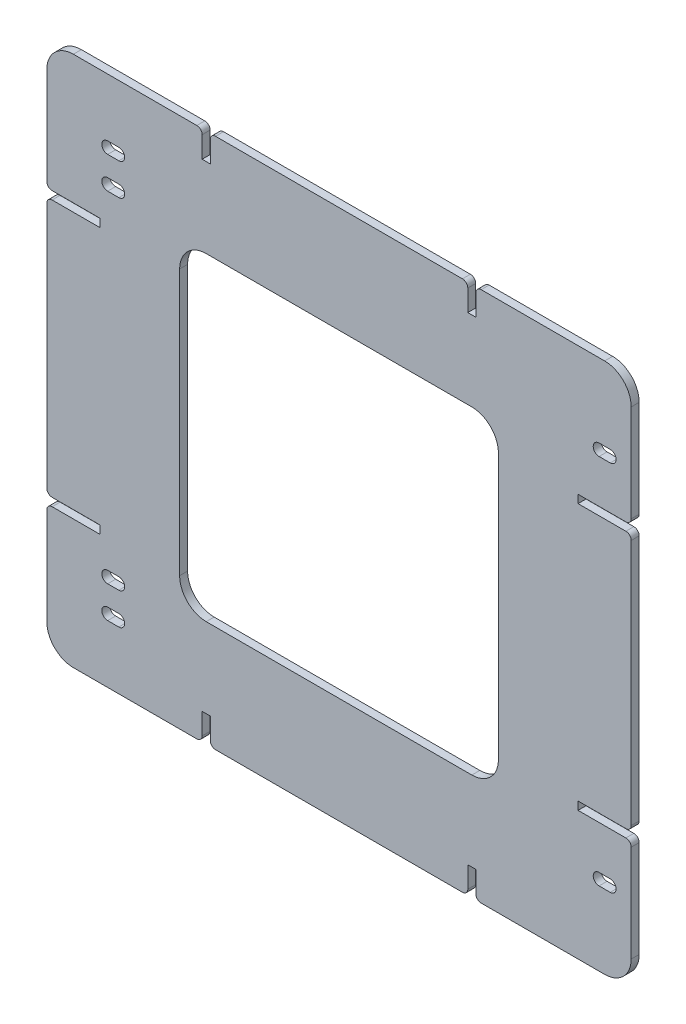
ISO-10303-21;
HEADER;
FILE_DESCRIPTION(('STEP AP214'),'2;1');
FILE_NAME('part.step','',(''),(''),'','','');
FILE_SCHEMA(('AUTOMOTIVE_DESIGN { 1 0 10303 214 1 1 1 1 }'));
ENDSEC;
DATA;
#1=APPLICATION_CONTEXT('core data for automotive mechanical design processes');
#2=APPLICATION_PROTOCOL_DEFINITION('international standard','automotive_design',2000,#1);
#3=PRODUCT_CONTEXT('',#1,'mechanical');
#4=PRODUCT('Part','Part','',(#3));
#5=PRODUCT_RELATED_PRODUCT_CATEGORY('part','',(#4));
#6=PRODUCT_DEFINITION_FORMATION('','',#4);
#7=PRODUCT_DEFINITION_CONTEXT('part definition',#1,'design');
#8=PRODUCT_DEFINITION('design','',#6,#7);
#9=PRODUCT_DEFINITION_SHAPE('','',#8);
#10=(LENGTH_UNIT() NAMED_UNIT(*) SI_UNIT(.MILLI.,.METRE.));
#11=(NAMED_UNIT(*) PLANE_ANGLE_UNIT() SI_UNIT($,.RADIAN.));
#12=(NAMED_UNIT(*) SI_UNIT($,.STERADIAN.) SOLID_ANGLE_UNIT());
#13=UNCERTAINTY_MEASURE_WITH_UNIT(LENGTH_MEASURE(1.E-05),#10,'distance_accuracy_value','');
#14=(GEOMETRIC_REPRESENTATION_CONTEXT(3) GLOBAL_UNCERTAINTY_ASSIGNED_CONTEXT((#13)) GLOBAL_UNIT_ASSIGNED_CONTEXT((#10,
#11,#12)) REPRESENTATION_CONTEXT('',''));
#15=CARTESIAN_POINT('',(0.,0.,0.));
#16=DIRECTION('',(0.,0.,1.));
#17=DIRECTION('',(1.,0.,0.));
#18=AXIS2_PLACEMENT_3D('',#15,#16,#17);
#19=CARTESIAN_POINT('',(-110.,100.,3.));
#20=DIRECTION('',(1.,0.,0.));
#21=DIRECTION('',(0.,1.,0.));
#22=AXIS2_PLACEMENT_3D('',#19,#20,#21);
#23=PLANE('',#22);
#24=DIRECTION('',(0.,-1.,0.));
#25=VECTOR('',#24,1.);
#26=CARTESIAN_POINT('',(-110.,100.,3.));
#27=LINE('',#26,#25);
#28=CARTESIAN_POINT('',(-110.,-53.525,3.));
#29=VERTEX_POINT('',#28);
#30=CARTESIAN_POINT('',(-110.,-90.,3.));
#31=VERTEX_POINT('',#30);
#32=EDGE_CURVE('E897',#29,#31,#27,.T.);
#33=ORIENTED_EDGE('',*,*,#32,.F.);
#34=DIRECTION('',(0.,0.,-1.));
#35=VECTOR('',#34,1.);
#36=CARTESIAN_POINT('',(-110.,-53.525,3.));
#37=LINE('',#36,#35);
#38=CARTESIAN_POINT('',(-110.,-53.525,0.));
#39=VERTEX_POINT('',#38);
#40=EDGE_CURVE('E1023',#29,#39,#37,.T.);
#41=ORIENTED_EDGE('',*,*,#40,.T.);
#42=DIRECTION('',(0.,-1.,0.));
#43=VECTOR('',#42,1.);
#44=CARTESIAN_POINT('',(-110.,100.,0.));
#45=LINE('',#44,#43);
#46=CARTESIAN_POINT('',(-110.,-90.,0.));
#47=VERTEX_POINT('',#46);
#48=EDGE_CURVE('E917',#39,#47,#45,.T.);
#49=ORIENTED_EDGE('',*,*,#48,.T.);
#50=DIRECTION('',(0.,0.,-1.));
#51=VECTOR('',#50,1.);
#52=CARTESIAN_POINT('',(-110.,-90.,3.));
#53=LINE('',#52,#51);
#54=EDGE_CURVE('E959',#47,#31,#53,.F.);
#55=ORIENTED_EDGE('',*,*,#54,.T.);
#56=EDGE_LOOP('',(#33,#41,#49,#55));
#57=FACE_BOUND('',#56,.T.);
#58=ADVANCED_FACE('F35',(#57),#23,.F.);
#59=CARTESIAN_POINT('',(110.,100.,3.));
#60=DIRECTION('',(-1.,0.,0.));
#61=DIRECTION('',(0.,-1.,0.));
#62=AXIS2_PLACEMENT_3D('',#59,#60,#61);
#63=PLANE('',#62);
#64=DIRECTION('',(0.,1.,0.));
#65=VECTOR('',#64,1.);
#66=CARTESIAN_POINT('',(110.,100.,3.));
#67=LINE('',#66,#65);
#68=CARTESIAN_POINT('',(110.,-46.475,3.));
#69=VERTEX_POINT('',#68);
#70=CARTESIAN_POINT('',(110.,46.475,3.));
#71=VERTEX_POINT('',#70);
#72=EDGE_CURVE('E892',#69,#71,#67,.T.);
#73=ORIENTED_EDGE('',*,*,#72,.F.);
#74=DIRECTION('',(0.,0.,-1.));
#75=VECTOR('',#74,1.);
#76=CARTESIAN_POINT('',(110.,-46.475,3.));
#77=LINE('',#76,#75);
#78=CARTESIAN_POINT('',(110.,-46.475,0.));
#79=VERTEX_POINT('',#78);
#80=EDGE_CURVE('E1135',#69,#79,#77,.T.);
#81=ORIENTED_EDGE('',*,*,#80,.T.);
#82=DIRECTION('',(0.,1.,0.));
#83=VECTOR('',#82,1.);
#84=CARTESIAN_POINT('',(110.,100.,0.));
#85=LINE('',#84,#83);
#86=CARTESIAN_POINT('',(110.,46.475,0.));
#87=VERTEX_POINT('',#86);
#88=EDGE_CURVE('E913',#79,#87,#85,.T.);
#89=ORIENTED_EDGE('',*,*,#88,.T.);
#90=DIRECTION('',(0.,0.,1.));
#91=VECTOR('',#90,1.);
#92=CARTESIAN_POINT('',(110.,46.475,3.));
#93=LINE('',#92,#91);
#94=EDGE_CURVE('E1132',#87,#71,#93,.T.);
#95=ORIENTED_EDGE('',*,*,#94,.T.);
#96=EDGE_LOOP('',(#73,#81,#89,#95));
#97=FACE_BOUND('',#96,.T.);
#98=ADVANCED_FACE('F1251',(#97),#63,.F.);
#99=CARTESIAN_POINT('',(110.,-90.,0.));
#100=VERTEX_POINT('',#99);
#101=CARTESIAN_POINT('',(110.,-53.525,0.));
#102=VERTEX_POINT('',#101);
#103=EDGE_CURVE('E909',#100,#102,#85,.T.);
#104=ORIENTED_EDGE('',*,*,#103,.T.);
#105=DIRECTION('',(0.,0.,1.));
#106=VECTOR('',#105,1.);
#107=CARTESIAN_POINT('',(110.,-53.525,3.));
#108=LINE('',#107,#106);
#109=CARTESIAN_POINT('',(110.,-53.525,3.));
#110=VERTEX_POINT('',#109);
#111=EDGE_CURVE('E1095',#102,#110,#108,.T.);
#112=ORIENTED_EDGE('',*,*,#111,.T.);
#113=CARTESIAN_POINT('',(110.,-90.,3.));
#114=VERTEX_POINT('',#113);
#115=EDGE_CURVE('E888',#114,#110,#67,.T.);
#116=ORIENTED_EDGE('',*,*,#115,.F.);
#117=DIRECTION('',(0.,0.,-1.));
#118=VECTOR('',#117,1.);
#119=CARTESIAN_POINT('',(110.,-90.,3.));
#120=LINE('',#119,#118);
#121=EDGE_CURVE('E930',#114,#100,#120,.T.);
#122=ORIENTED_EDGE('',*,*,#121,.T.);
#123=EDGE_LOOP('',(#104,#112,#116,#122));
#124=FACE_BOUND('',#123,.T.);
#125=ADVANCED_FACE('F1261',(#124),#63,.F.);
#126=CARTESIAN_POINT('',(-110.,100.,3.));
#127=DIRECTION('',(0.,-1.,0.));
#128=DIRECTION('',(0.,0.,-1.));
#129=AXIS2_PLACEMENT_3D('',#126,#127,#128);
#130=PLANE('',#129);
#131=DIRECTION('',(-1.,0.,0.));
#132=VECTOR('',#131,1.);
#133=CARTESIAN_POINT('',(-110.,100.,3.));
#134=LINE('',#133,#132);
#135=CARTESIAN_POINT('',(-53.525,100.,3.));
#136=VERTEX_POINT('',#135);
#137=CARTESIAN_POINT('',(-100.,100.,3.));
#138=VERTEX_POINT('',#137);
#139=EDGE_CURVE('E891',#136,#138,#134,.T.);
#140=ORIENTED_EDGE('',*,*,#139,.F.);
#141=DIRECTION('',(0.,0.,-1.));
#142=VECTOR('',#141,1.);
#143=CARTESIAN_POINT('',(-53.525,100.,3.));
#144=LINE('',#143,#142);
#145=CARTESIAN_POINT('',(-53.525,100.,0.));
#146=VERTEX_POINT('',#145);
#147=EDGE_CURVE('E1162',#136,#146,#144,.T.);
#148=ORIENTED_EDGE('',*,*,#147,.T.);
#149=DIRECTION('',(-1.,0.,0.));
#150=VECTOR('',#149,1.);
#151=CARTESIAN_POINT('',(-110.,100.,0.));
#152=LINE('',#151,#150);
#153=CARTESIAN_POINT('',(-100.,100.,0.));
#154=VERTEX_POINT('',#153);
#155=EDGE_CURVE('E912',#146,#154,#152,.T.);
#156=ORIENTED_EDGE('',*,*,#155,.T.);
#157=DIRECTION('',(0.,0.,-1.));
#158=VECTOR('',#157,1.);
#159=CARTESIAN_POINT('',(-100.,100.,3.));
#160=LINE('',#159,#158);
#161=EDGE_CURVE('E968',#154,#138,#160,.F.);
#162=ORIENTED_EDGE('',*,*,#161,.T.);
#163=EDGE_LOOP('',(#140,#148,#156,#162));
#164=FACE_BOUND('',#163,.T.);
#165=ADVANCED_FACE('F1282',(#164),#130,.F.);
#166=CARTESIAN_POINT('',(46.475,100.,3.));
#167=VERTEX_POINT('',#166);
#168=CARTESIAN_POINT('',(-46.475,100.,3.));
#169=VERTEX_POINT('',#168);
#170=EDGE_CURVE('E898',#167,#169,#134,.T.);
#171=ORIENTED_EDGE('',*,*,#170,.F.);
#172=DIRECTION('',(0.,0.,-1.));
#173=VECTOR('',#172,1.);
#174=CARTESIAN_POINT('',(46.475,100.,3.));
#175=LINE('',#174,#173);
#176=CARTESIAN_POINT('',(46.475,100.,0.));
#177=VERTEX_POINT('',#176);
#178=EDGE_CURVE('E1150',#167,#177,#175,.T.);
#179=ORIENTED_EDGE('',*,*,#178,.T.);
#180=CARTESIAN_POINT('',(-46.475,100.,0.));
#181=VERTEX_POINT('',#180);
#182=EDGE_CURVE('E918',#177,#181,#152,.T.);
#183=ORIENTED_EDGE('',*,*,#182,.T.);
#184=DIRECTION('',(0.,0.,1.));
#185=VECTOR('',#184,1.);
#186=CARTESIAN_POINT('',(-46.475,100.,3.));
#187=LINE('',#186,#185);
#188=EDGE_CURVE('E1147',#181,#169,#187,.T.);
#189=ORIENTED_EDGE('',*,*,#188,.T.);
#190=EDGE_LOOP('',(#171,#179,#183,#189));
#191=FACE_BOUND('',#190,.T.);
#192=ADVANCED_FACE('F1283',(#191),#130,.F.);
#193=CARTESIAN_POINT('',(-110.,-100.,3.));
#194=DIRECTION('',(0.,1.,0.));
#195=DIRECTION('',(0.,0.,1.));
#196=AXIS2_PLACEMENT_3D('',#193,#194,#195);
#197=PLANE('',#196);
#198=DIRECTION('',(1.,0.,0.));
#199=VECTOR('',#198,1.);
#200=CARTESIAN_POINT('',(-110.,-100.,3.));
#201=LINE('',#200,#199);
#202=CARTESIAN_POINT('',(53.525,-100.,3.));
#203=VERTEX_POINT('',#202);
#204=CARTESIAN_POINT('',(100.,-100.,3.));
#205=VERTEX_POINT('',#204);
#206=EDGE_CURVE('E902',#203,#205,#201,.T.);
#207=ORIENTED_EDGE('',*,*,#206,.F.);
#208=DIRECTION('',(0.,0.,-1.));
#209=VECTOR('',#208,1.);
#210=CARTESIAN_POINT('',(53.525,-100.,3.));
#211=LINE('',#210,#209);
#212=CARTESIAN_POINT('',(53.525,-100.,0.));
#213=VERTEX_POINT('',#212);
#214=EDGE_CURVE('E1081',#203,#213,#211,.T.);
#215=ORIENTED_EDGE('',*,*,#214,.T.);
#216=DIRECTION('',(1.,0.,0.));
#217=VECTOR('',#216,1.);
#218=CARTESIAN_POINT('',(-110.,-100.,0.));
#219=LINE('',#218,#217);
#220=CARTESIAN_POINT('',(100.,-100.,0.));
#221=VERTEX_POINT('',#220);
#222=EDGE_CURVE('E922',#213,#221,#219,.T.);
#223=ORIENTED_EDGE('',*,*,#222,.T.);
#224=DIRECTION('',(0.,0.,-1.));
#225=VECTOR('',#224,1.);
#226=CARTESIAN_POINT('',(100.,-100.,3.));
#227=LINE('',#226,#225);
#228=EDGE_CURVE('E948',#221,#205,#227,.F.);
#229=ORIENTED_EDGE('',*,*,#228,.T.);
#230=EDGE_LOOP('',(#207,#215,#223,#229));
#231=FACE_BOUND('',#230,.T.);
#232=ADVANCED_FACE('F1279',(#231),#197,.F.);
#233=CARTESIAN_POINT('',(-46.475,-100.,3.));
#234=VERTEX_POINT('',#233);
#235=CARTESIAN_POINT('',(46.475,-100.,3.));
#236=VERTEX_POINT('',#235);
#237=EDGE_CURVE('E908',#234,#236,#201,.T.);
#238=ORIENTED_EDGE('',*,*,#237,.F.);
#239=DIRECTION('',(0.,0.,-1.));
#240=VECTOR('',#239,1.);
#241=CARTESIAN_POINT('',(-46.475,-100.,3.));
#242=LINE('',#241,#240);
#243=CARTESIAN_POINT('',(-46.475,-100.,0.));
#244=VERTEX_POINT('',#243);
#245=EDGE_CURVE('E1071',#234,#244,#242,.T.);
#246=ORIENTED_EDGE('',*,*,#245,.T.);
#247=CARTESIAN_POINT('',(46.475,-100.,0.));
#248=VERTEX_POINT('',#247);
#249=EDGE_CURVE('E927',#244,#248,#219,.T.);
#250=ORIENTED_EDGE('',*,*,#249,.T.);
#251=DIRECTION('',(0.,0.,1.));
#252=VECTOR('',#251,1.);
#253=CARTESIAN_POINT('',(46.475,-100.,3.));
#254=LINE('',#253,#252);
#255=EDGE_CURVE('E1068',#248,#236,#254,.T.);
#256=ORIENTED_EDGE('',*,*,#255,.T.);
#257=EDGE_LOOP('',(#238,#246,#250,#256));
#258=FACE_BOUND('',#257,.T.);
#259=ADVANCED_FACE('F1269',(#258),#197,.F.);
#260=CARTESIAN_POINT('',(-110.,46.475,0.));
#261=VERTEX_POINT('',#260);
#262=CARTESIAN_POINT('',(-110.,-46.475,0.));
#263=VERTEX_POINT('',#262);
#264=EDGE_CURVE('E923',#261,#263,#45,.T.);
#265=ORIENTED_EDGE('',*,*,#264,.T.);
#266=DIRECTION('',(0.,0.,1.));
#267=VECTOR('',#266,1.);
#268=CARTESIAN_POINT('',(-110.,-46.475,3.));
#269=LINE('',#268,#267);
#270=CARTESIAN_POINT('',(-110.,-46.475,3.));
#271=VERTEX_POINT('',#270);
#272=EDGE_CURVE('E1063',#263,#271,#269,.T.);
#273=ORIENTED_EDGE('',*,*,#272,.T.);
#274=CARTESIAN_POINT('',(-110.,46.475,3.));
#275=VERTEX_POINT('',#274);
#276=EDGE_CURVE('E903',#275,#271,#27,.T.);
#277=ORIENTED_EDGE('',*,*,#276,.F.);
#278=DIRECTION('',(0.,0.,-1.));
#279=VECTOR('',#278,1.);
#280=CARTESIAN_POINT('',(-110.,46.475,3.));
#281=LINE('',#280,#279);
#282=EDGE_CURVE('E1060',#275,#261,#281,.T.);
#283=ORIENTED_EDGE('',*,*,#282,.T.);
#284=EDGE_LOOP('',(#265,#273,#277,#283));
#285=FACE_BOUND('',#284,.T.);
#286=ADVANCED_FACE('F1254',(#285),#23,.F.);
#287=CARTESIAN_POINT('',(110.,53.525,3.));
#288=VERTEX_POINT('',#287);
#289=CARTESIAN_POINT('',(110.,90.,3.));
#290=VERTEX_POINT('',#289);
#291=EDGE_CURVE('E893',#288,#290,#67,.T.);
#292=ORIENTED_EDGE('',*,*,#291,.F.);
#293=DIRECTION('',(0.,0.,-1.));
#294=VECTOR('',#293,1.);
#295=CARTESIAN_POINT('',(110.,53.525,3.));
#296=LINE('',#295,#294);
#297=CARTESIAN_POINT('',(110.,53.525,0.));
#298=VERTEX_POINT('',#297);
#299=EDGE_CURVE('E1142',#288,#298,#296,.T.);
#300=ORIENTED_EDGE('',*,*,#299,.T.);
#301=CARTESIAN_POINT('',(110.,90.,0.));
#302=VERTEX_POINT('',#301);
#303=EDGE_CURVE('E877',#298,#302,#85,.T.);
#304=ORIENTED_EDGE('',*,*,#303,.T.);
#305=DIRECTION('',(0.,0.,-1.));
#306=VECTOR('',#305,1.);
#307=CARTESIAN_POINT('',(110.,90.,3.));
#308=LINE('',#307,#306);
#309=EDGE_CURVE('E907',#302,#290,#308,.F.);
#310=ORIENTED_EDGE('',*,*,#309,.T.);
#311=EDGE_LOOP('',(#292,#300,#304,#310));
#312=FACE_BOUND('',#311,.T.);
#313=ADVANCED_FACE('F1264',(#312),#63,.F.);
#314=CARTESIAN_POINT('',(100.,100.,0.));
#315=VERTEX_POINT('',#314);
#316=CARTESIAN_POINT('',(53.525,100.,0.));
#317=VERTEX_POINT('',#316);
#318=EDGE_CURVE('E914',#315,#317,#152,.T.);
#319=ORIENTED_EDGE('',*,*,#318,.T.);
#320=DIRECTION('',(0.,0.,1.));
#321=VECTOR('',#320,1.);
#322=CARTESIAN_POINT('',(53.525,100.,3.));
#323=LINE('',#322,#321);
#324=CARTESIAN_POINT('',(53.525,100.,3.));
#325=VERTEX_POINT('',#324);
#326=EDGE_CURVE('E1155',#317,#325,#323,.T.);
#327=ORIENTED_EDGE('',*,*,#326,.T.);
#328=CARTESIAN_POINT('',(100.,100.,3.));
#329=VERTEX_POINT('',#328);
#330=EDGE_CURVE('E894',#329,#325,#134,.T.);
#331=ORIENTED_EDGE('',*,*,#330,.F.);
#332=DIRECTION('',(0.,0.,-1.));
#333=VECTOR('',#332,1.);
#334=CARTESIAN_POINT('',(100.,100.,3.));
#335=LINE('',#334,#333);
#336=EDGE_CURVE('E965',#329,#315,#335,.T.);
#337=ORIENTED_EDGE('',*,*,#336,.T.);
#338=EDGE_LOOP('',(#319,#327,#331,#337));
#339=FACE_BOUND('',#338,.T.);
#340=ADVANCED_FACE('F1273',(#339),#130,.F.);
#341=CARTESIAN_POINT('',(-110.,90.,0.));
#342=VERTEX_POINT('',#341);
#343=CARTESIAN_POINT('',(-110.,53.525,0.));
#344=VERTEX_POINT('',#343);
#345=EDGE_CURVE('E919',#342,#344,#45,.T.);
#346=ORIENTED_EDGE('',*,*,#345,.T.);
#347=DIRECTION('',(0.,0.,1.));
#348=VECTOR('',#347,1.);
#349=CARTESIAN_POINT('',(-110.,53.525,3.));
#350=LINE('',#349,#348);
#351=CARTESIAN_POINT('',(-110.,53.525,3.));
#352=VERTEX_POINT('',#351);
#353=EDGE_CURVE('E1090',#344,#352,#350,.T.);
#354=ORIENTED_EDGE('',*,*,#353,.T.);
#355=CARTESIAN_POINT('',(-110.,90.,3.));
#356=VERTEX_POINT('',#355);
#357=EDGE_CURVE('E899',#356,#352,#27,.T.);
#358=ORIENTED_EDGE('',*,*,#357,.F.);
#359=DIRECTION('',(0.,0.,-1.));
#360=VECTOR('',#359,1.);
#361=CARTESIAN_POINT('',(-110.,90.,3.));
#362=LINE('',#361,#360);
#363=EDGE_CURVE('E962',#356,#342,#362,.T.);
#364=ORIENTED_EDGE('',*,*,#363,.T.);
#365=EDGE_LOOP('',(#346,#354,#358,#364));
#366=FACE_BOUND('',#365,.T.);
#367=ADVANCED_FACE('F1255',(#366),#23,.F.);
#368=CARTESIAN_POINT('',(-100.,-100.,0.));
#369=VERTEX_POINT('',#368);
#370=CARTESIAN_POINT('',(-53.525,-100.,0.));
#371=VERTEX_POINT('',#370);
#372=EDGE_CURVE('E924',#369,#371,#219,.T.);
#373=ORIENTED_EDGE('',*,*,#372,.T.);
#374=DIRECTION('',(0.,0.,1.));
#375=VECTOR('',#374,1.);
#376=CARTESIAN_POINT('',(-53.525,-100.,3.));
#377=LINE('',#376,#375);
#378=CARTESIAN_POINT('',(-53.525,-100.,3.));
#379=VERTEX_POINT('',#378);
#380=EDGE_CURVE('E1076',#371,#379,#377,.T.);
#381=ORIENTED_EDGE('',*,*,#380,.T.);
#382=CARTESIAN_POINT('',(-100.,-100.,3.));
#383=VERTEX_POINT('',#382);
#384=EDGE_CURVE('E904',#383,#379,#201,.T.);
#385=ORIENTED_EDGE('',*,*,#384,.F.);
#386=DIRECTION('',(0.,0.,-1.));
#387=VECTOR('',#386,1.);
#388=CARTESIAN_POINT('',(-100.,-100.,3.));
#389=LINE('',#388,#387);
#390=EDGE_CURVE('E945',#383,#369,#389,.T.);
#391=ORIENTED_EDGE('',*,*,#390,.T.);
#392=EDGE_LOOP('',(#373,#381,#385,#391));
#393=FACE_BOUND('',#392,.T.);
#394=ADVANCED_FACE('F1272',(#393),#197,.F.);
#395=CARTESIAN_POINT('',(0.,0.,3.));
#396=DIRECTION('',(0.,0.,1.));
#397=DIRECTION('',(1.,0.,0.));
#398=AXIS2_PLACEMENT_3D('',#395,#396,#397);
#399=PLANE('',#398);
#400=CARTESIAN_POINT('',(97.9000000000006,69.9999999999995,3.));
#401=DIRECTION('',(0.,0.,1.));
#402=DIRECTION('',(1.,0.,0.));
#403=AXIS2_PLACEMENT_3D('',#400,#401,#402);
#404=CIRCLE('',#403,2.19999999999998);
#405=CARTESIAN_POINT('',(97.9000000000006,72.1999999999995,3.));
#406=VERTEX_POINT('',#405);
#407=CARTESIAN_POINT('',(97.9000000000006,67.7999999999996,3.));
#408=VERTEX_POINT('',#407);
#409=EDGE_CURVE('E50',#406,#408,#404,.T.);
#410=ORIENTED_EDGE('',*,*,#409,.F.);
#411=DIRECTION('',(-1.,0.,0.));
#412=VECTOR('',#411,1.);
#413=CARTESIAN_POINT('',(97.9000000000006,72.1999999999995,3.));
#414=LINE('',#413,#412);
#415=CARTESIAN_POINT('',(102.100000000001,72.1999999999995,3.));
#416=VERTEX_POINT('',#415);
#417=EDGE_CURVE('E604',#416,#406,#414,.T.);
#418=ORIENTED_EDGE('',*,*,#417,.F.);
#419=CARTESIAN_POINT('',(102.100000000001,69.9999999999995,3.));
#420=DIRECTION('',(0.,0.,1.));
#421=DIRECTION('',(1.,0.,0.));
#422=AXIS2_PLACEMENT_3D('',#419,#420,#421);
#423=CIRCLE('',#422,2.19999999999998);
#424=CARTESIAN_POINT('',(102.100000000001,67.7999999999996,3.));
#425=VERTEX_POINT('',#424);
#426=EDGE_CURVE('E587',#425,#416,#423,.T.);
#427=ORIENTED_EDGE('',*,*,#426,.F.);
#428=DIRECTION('',(1.,0.,0.));
#429=VECTOR('',#428,1.);
#430=CARTESIAN_POINT('',(97.9000000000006,67.7999999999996,3.));
#431=LINE('',#430,#429);
#432=EDGE_CURVE('E597',#408,#425,#431,.T.);
#433=ORIENTED_EDGE('',*,*,#432,.F.);
#434=EDGE_LOOP('',(#410,#418,#427,#433));
#435=FACE_BOUND('',#434,.T.);
#436=CARTESIAN_POINT('',(97.9000000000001,-70.0000000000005,3.));
#437=DIRECTION('',(0.,0.,1.));
#438=DIRECTION('',(1.,0.,0.));
#439=AXIS2_PLACEMENT_3D('',#436,#437,#438);
#440=CIRCLE('',#439,2.19999999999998);
#441=CARTESIAN_POINT('',(97.9000000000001,-67.8000000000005,3.));
#442=VERTEX_POINT('',#441);
#443=CARTESIAN_POINT('',(97.9000000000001,-72.2000000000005,3.));
#444=VERTEX_POINT('',#443);
#445=EDGE_CURVE('E58',#442,#444,#440,.T.);
#446=ORIENTED_EDGE('',*,*,#445,.F.);
#447=DIRECTION('',(-1.,0.,0.));
#448=VECTOR('',#447,1.);
#449=CARTESIAN_POINT('',(97.9000000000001,-67.8000000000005,3.));
#450=LINE('',#449,#448);
#451=CARTESIAN_POINT('',(102.1,-67.8000000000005,3.));
#452=VERTEX_POINT('',#451);
#453=EDGE_CURVE('E622',#452,#442,#450,.T.);
#454=ORIENTED_EDGE('',*,*,#453,.F.);
#455=CARTESIAN_POINT('',(102.1,-70.0000000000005,3.));
#456=DIRECTION('',(0.,0.,1.));
#457=DIRECTION('',(1.,0.,0.));
#458=AXIS2_PLACEMENT_3D('',#455,#456,#457);
#459=CIRCLE('',#458,2.19999999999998);
#460=CARTESIAN_POINT('',(102.1,-72.2000000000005,3.));
#461=VERTEX_POINT('',#460);
#462=EDGE_CURVE('E619',#461,#452,#459,.T.);
#463=ORIENTED_EDGE('',*,*,#462,.F.);
#464=DIRECTION('',(1.,0.,0.));
#465=VECTOR('',#464,1.);
#466=CARTESIAN_POINT('',(97.9000000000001,-72.2000000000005,3.));
#467=LINE('',#466,#465);
#468=EDGE_CURVE('E615',#444,#461,#467,.T.);
#469=ORIENTED_EDGE('',*,*,#468,.F.);
#470=EDGE_LOOP('',(#446,#454,#463,#469));
#471=FACE_BOUND('',#470,.T.);
#472=CARTESIAN_POINT('',(-87.1000000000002,64.0000000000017,3.));
#473=DIRECTION('',(0.,0.,1.));
#474=DIRECTION('',(1.,0.,0.));
#475=AXIS2_PLACEMENT_3D('',#472,#473,#474);
#476=CIRCLE('',#475,2.19999999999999);
#477=CARTESIAN_POINT('',(-87.1000000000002,66.2000000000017,3.));
#478=VERTEX_POINT('',#477);
#479=CARTESIAN_POINT('',(-87.1000000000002,61.8000000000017,3.));
#480=VERTEX_POINT('',#479);
#481=EDGE_CURVE('E655',#478,#480,#476,.T.);
#482=ORIENTED_EDGE('',*,*,#481,.F.);
#483=DIRECTION('',(-1.,0.,0.));
#484=VECTOR('',#483,1.);
#485=CARTESIAN_POINT('',(-87.1000000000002,66.2000000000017,3.));
#486=LINE('',#485,#484);
#487=CARTESIAN_POINT('',(-82.9000000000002,66.2000000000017,3.));
#488=VERTEX_POINT('',#487);
#489=EDGE_CURVE('E663',#488,#478,#486,.T.);
#490=ORIENTED_EDGE('',*,*,#489,.F.);
#491=CARTESIAN_POINT('',(-82.9000000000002,64.0000000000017,3.));
#492=DIRECTION('',(0.,0.,1.));
#493=DIRECTION('',(1.,0.,0.));
#494=AXIS2_PLACEMENT_3D('',#491,#492,#493);
#495=CIRCLE('',#494,2.19999999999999);
#496=CARTESIAN_POINT('',(-82.9000000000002,61.8000000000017,3.));
#497=VERTEX_POINT('',#496);
#498=EDGE_CURVE('E660',#497,#488,#495,.T.);
#499=ORIENTED_EDGE('',*,*,#498,.F.);
#500=DIRECTION('',(1.,0.,0.));
#501=VECTOR('',#500,1.);
#502=CARTESIAN_POINT('',(-87.1000000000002,61.8000000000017,3.));
#503=LINE('',#502,#501);
#504=EDGE_CURVE('E657',#480,#497,#503,.T.);
#505=ORIENTED_EDGE('',*,*,#504,.F.);
#506=EDGE_LOOP('',(#482,#490,#499,#505));
#507=FACE_BOUND('',#506,.T.);
#508=CARTESIAN_POINT('',(-87.1000000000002,-75.9999999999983,3.));
#509=DIRECTION('',(0.,0.,1.));
#510=DIRECTION('',(1.,0.,0.));
#511=AXIS2_PLACEMENT_3D('',#508,#509,#510);
#512=CIRCLE('',#511,2.19999999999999);
#513=CARTESIAN_POINT('',(-87.1000000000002,-73.7999999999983,3.));
#514=VERTEX_POINT('',#513);
#515=CARTESIAN_POINT('',(-87.1000000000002,-78.1999999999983,3.));
#516=VERTEX_POINT('',#515);
#517=EDGE_CURVE('E633',#514,#516,#512,.T.);
#518=ORIENTED_EDGE('',*,*,#517,.F.);
#519=DIRECTION('',(-1.,0.,0.));
#520=VECTOR('',#519,1.);
#521=CARTESIAN_POINT('',(-87.1000000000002,-73.7999999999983,3.));
#522=LINE('',#521,#520);
#523=CARTESIAN_POINT('',(-82.9000000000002,-73.7999999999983,3.));
#524=VERTEX_POINT('',#523);
#525=EDGE_CURVE('E642',#524,#514,#522,.T.);
#526=ORIENTED_EDGE('',*,*,#525,.F.);
#527=CARTESIAN_POINT('',(-82.9000000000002,-75.9999999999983,3.));
#528=DIRECTION('',(0.,0.,1.));
#529=DIRECTION('',(1.,0.,0.));
#530=AXIS2_PLACEMENT_3D('',#527,#528,#529);
#531=CIRCLE('',#530,2.19999999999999);
#532=CARTESIAN_POINT('',(-82.9000000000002,-78.1999999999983,3.));
#533=VERTEX_POINT('',#532);
#534=EDGE_CURVE('E639',#533,#524,#531,.T.);
#535=ORIENTED_EDGE('',*,*,#534,.F.);
#536=DIRECTION('',(1.,0.,0.));
#537=VECTOR('',#536,1.);
#538=CARTESIAN_POINT('',(-87.1000000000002,-78.1999999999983,3.));
#539=LINE('',#538,#537);
#540=EDGE_CURVE('E635',#516,#533,#539,.T.);
#541=ORIENTED_EDGE('',*,*,#540,.F.);
#542=EDGE_LOOP('',(#518,#526,#535,#541));
#543=FACE_BOUND('',#542,.T.);
#544=CARTESIAN_POINT('',(-87.1000000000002,-63.9999999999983,3.));
#545=DIRECTION('',(0.,0.,1.));
#546=DIRECTION('',(1.,0.,0.));
#547=AXIS2_PLACEMENT_3D('',#544,#545,#546);
#548=CIRCLE('',#547,2.19999999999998);
#549=CARTESIAN_POINT('',(-87.1000000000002,-61.7999999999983,3.));
#550=VERTEX_POINT('',#549);
#551=CARTESIAN_POINT('',(-87.1000000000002,-66.1999999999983,3.));
#552=VERTEX_POINT('',#551);
#553=EDGE_CURVE('E648',#550,#552,#548,.T.);
#554=ORIENTED_EDGE('',*,*,#553,.F.);
#555=DIRECTION('',(-1.,0.,0.));
#556=VECTOR('',#555,1.);
#557=CARTESIAN_POINT('',(-87.1000000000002,-61.7999999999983,3.));
#558=LINE('',#557,#556);
#559=CARTESIAN_POINT('',(-82.9000000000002,-61.7999999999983,3.));
#560=VERTEX_POINT('',#559);
#561=EDGE_CURVE('E681',#560,#550,#558,.T.);
#562=ORIENTED_EDGE('',*,*,#561,.F.);
#563=CARTESIAN_POINT('',(-82.9000000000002,-63.9999999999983,3.));
#564=DIRECTION('',(0.,0.,1.));
#565=DIRECTION('',(1.,0.,0.));
#566=AXIS2_PLACEMENT_3D('',#563,#564,#565);
#567=CIRCLE('',#566,2.19999999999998);
#568=CARTESIAN_POINT('',(-82.9000000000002,-66.1999999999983,3.));
#569=VERTEX_POINT('',#568);
#570=EDGE_CURVE('E678',#569,#560,#567,.T.);
#571=ORIENTED_EDGE('',*,*,#570,.F.);
#572=DIRECTION('',(1.,0.,0.));
#573=VECTOR('',#572,1.);
#574=CARTESIAN_POINT('',(-87.1000000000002,-66.1999999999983,3.));
#575=LINE('',#574,#573);
#576=EDGE_CURVE('E675',#552,#569,#575,.T.);
#577=ORIENTED_EDGE('',*,*,#576,.F.);
#578=EDGE_LOOP('',(#554,#562,#571,#577));
#579=FACE_BOUND('',#578,.T.);
#580=CARTESIAN_POINT('',(-87.0999999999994,75.9999999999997,3.));
#581=DIRECTION('',(0.,0.,1.));
#582=DIRECTION('',(1.,0.,0.));
#583=AXIS2_PLACEMENT_3D('',#580,#581,#582);
#584=CIRCLE('',#583,2.19999999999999);
#585=CARTESIAN_POINT('',(-87.0999999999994,78.1999999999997,3.));
#586=VERTEX_POINT('',#585);
#587=CARTESIAN_POINT('',(-87.0999999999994,73.7999999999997,3.));
#588=VERTEX_POINT('',#587);
#589=EDGE_CURVE('E611',#586,#588,#584,.T.);
#590=ORIENTED_EDGE('',*,*,#589,.F.);
#591=DIRECTION('',(-1.,0.,0.));
#592=VECTOR('',#591,1.);
#593=CARTESIAN_POINT('',(-87.0999999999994,78.1999999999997,3.));
#594=LINE('',#593,#592);
#595=CARTESIAN_POINT('',(-82.8999999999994,78.1999999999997,3.));
#596=VERTEX_POINT('',#595);
#597=EDGE_CURVE('E699',#596,#586,#594,.T.);
#598=ORIENTED_EDGE('',*,*,#597,.F.);
#599=CARTESIAN_POINT('',(-82.8999999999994,75.9999999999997,3.));
#600=DIRECTION('',(0.,0.,1.));
#601=DIRECTION('',(1.,0.,0.));
#602=AXIS2_PLACEMENT_3D('',#599,#600,#601);
#603=CIRCLE('',#602,2.19999999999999);
#604=CARTESIAN_POINT('',(-82.8999999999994,73.7999999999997,3.));
#605=VERTEX_POINT('',#604);
#606=EDGE_CURVE('E696',#605,#596,#603,.T.);
#607=ORIENTED_EDGE('',*,*,#606,.F.);
#608=DIRECTION('',(1.,0.,0.));
#609=VECTOR('',#608,1.);
#610=CARTESIAN_POINT('',(-87.0999999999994,73.7999999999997,3.));
#611=LINE('',#610,#609);
#612=EDGE_CURVE('E693',#588,#605,#611,.T.);
#613=ORIENTED_EDGE('',*,*,#612,.F.);
#614=EDGE_LOOP('',(#590,#598,#607,#613));
#615=FACE_BOUND('',#614,.T.);
#616=ORIENTED_EDGE('',*,*,#115,.T.);
#617=CARTESIAN_POINT('',(108.,-53.525,3.));
#618=DIRECTION('',(0.,0.,1.));
#619=DIRECTION('',(1.,0.,0.));
#620=AXIS2_PLACEMENT_3D('',#617,#618,#619);
#621=CIRCLE('',#620,2.);
#622=CARTESIAN_POINT('',(108.,-51.525,3.));
#623=VERTEX_POINT('',#622);
#624=EDGE_CURVE('E1112',#110,#623,#621,.T.);
#625=ORIENTED_EDGE('',*,*,#624,.T.);
#626=DIRECTION('',(1.,0.,0.));
#627=VECTOR('',#626,1.);
#628=CARTESIAN_POINT('',(130.,-51.525,3.));
#629=LINE('',#628,#627);
#630=CARTESIAN_POINT('',(90.,-51.525,3.));
#631=VERTEX_POINT('',#630);
#632=EDGE_CURVE('E716',#631,#623,#629,.T.);
#633=ORIENTED_EDGE('',*,*,#632,.F.);
#634=DIRECTION('',(0.,-1.,0.));
#635=VECTOR('',#634,1.);
#636=CARTESIAN_POINT('',(90.,-48.475,3.));
#637=LINE('',#636,#635);
#638=CARTESIAN_POINT('',(90.,-48.475,3.));
#639=VERTEX_POINT('',#638);
#640=EDGE_CURVE('E722',#639,#631,#637,.T.);
#641=ORIENTED_EDGE('',*,*,#640,.F.);
#642=DIRECTION('',(-1.,0.,0.));
#643=VECTOR('',#642,1.);
#644=CARTESIAN_POINT('',(130.,-48.475,3.));
#645=LINE('',#644,#643);
#646=CARTESIAN_POINT('',(108.,-48.475,3.));
#647=VERTEX_POINT('',#646);
#648=EDGE_CURVE('E720',#647,#639,#645,.T.);
#649=ORIENTED_EDGE('',*,*,#648,.F.);
#650=CARTESIAN_POINT('',(108.,-46.475,3.));
#651=DIRECTION('',(0.,0.,1.));
#652=DIRECTION('',(1.,0.,0.));
#653=AXIS2_PLACEMENT_3D('',#650,#651,#652);
#654=CIRCLE('',#653,2.);
#655=EDGE_CURVE('E1110',#647,#69,#654,.T.);
#656=ORIENTED_EDGE('',*,*,#655,.T.);
#657=ORIENTED_EDGE('',*,*,#72,.T.);
#658=CARTESIAN_POINT('',(108.,46.475,3.));
#659=DIRECTION('',(0.,0.,1.));
#660=DIRECTION('',(1.,0.,0.));
#661=AXIS2_PLACEMENT_3D('',#658,#659,#660);
#662=CIRCLE('',#661,2.);
#663=CARTESIAN_POINT('',(108.,48.475,3.));
#664=VERTEX_POINT('',#663);
#665=EDGE_CURVE('E1108',#71,#664,#662,.T.);
#666=ORIENTED_EDGE('',*,*,#665,.T.);
#667=DIRECTION('',(1.,0.,0.));
#668=VECTOR('',#667,1.);
#669=CARTESIAN_POINT('',(130.,48.475,3.));
#670=LINE('',#669,#668);
#671=CARTESIAN_POINT('',(90.,48.475,3.));
#672=VERTEX_POINT('',#671);
#673=EDGE_CURVE('E737',#672,#664,#670,.T.);
#674=ORIENTED_EDGE('',*,*,#673,.F.);
#675=DIRECTION('',(0.,-1.,0.));
#676=VECTOR('',#675,1.);
#677=CARTESIAN_POINT('',(90.,51.525,3.));
#678=LINE('',#677,#676);
#679=CARTESIAN_POINT('',(90.,51.525,3.));
#680=VERTEX_POINT('',#679);
#681=EDGE_CURVE('E743',#680,#672,#678,.T.);
#682=ORIENTED_EDGE('',*,*,#681,.F.);
#683=DIRECTION('',(-1.,0.,0.));
#684=VECTOR('',#683,1.);
#685=CARTESIAN_POINT('',(130.,51.525,3.));
#686=LINE('',#685,#684);
#687=CARTESIAN_POINT('',(108.,51.525,3.));
#688=VERTEX_POINT('',#687);
#689=EDGE_CURVE('E741',#688,#680,#686,.T.);
#690=ORIENTED_EDGE('',*,*,#689,.F.);
#691=CARTESIAN_POINT('',(108.,53.525,3.));
#692=DIRECTION('',(0.,0.,1.));
#693=DIRECTION('',(1.,0.,0.));
#694=AXIS2_PLACEMENT_3D('',#691,#692,#693);
#695=CIRCLE('',#694,2.);
#696=EDGE_CURVE('E1106',#688,#288,#695,.T.);
#697=ORIENTED_EDGE('',*,*,#696,.T.);
#698=ORIENTED_EDGE('',*,*,#291,.T.);
#699=CARTESIAN_POINT('',(100.,90.,3.));
#700=DIRECTION('',(0.,0.,1.));
#701=DIRECTION('',(1.,0.,0.));
#702=AXIS2_PLACEMENT_3D('',#699,#700,#701);
#703=CIRCLE('',#702,10.);
#704=EDGE_CURVE('E953',#290,#329,#703,.T.);
#705=ORIENTED_EDGE('',*,*,#704,.T.);
#706=ORIENTED_EDGE('',*,*,#330,.T.);
#707=CARTESIAN_POINT('',(53.525,98.,3.));
#708=DIRECTION('',(0.,0.,1.));
#709=DIRECTION('',(1.,0.,0.));
#710=AXIS2_PLACEMENT_3D('',#707,#708,#709);
#711=CIRCLE('',#710,2.);
#712=CARTESIAN_POINT('',(51.525,98.,3.));
#713=VERTEX_POINT('',#712);
#714=EDGE_CURVE('E1102',#325,#713,#711,.T.);
#715=ORIENTED_EDGE('',*,*,#714,.T.);
#716=DIRECTION('',(0.,1.,0.));
#717=VECTOR('',#716,1.);
#718=CARTESIAN_POINT('',(51.525,110.,3.));
#719=LINE('',#718,#717);
#720=CARTESIAN_POINT('',(51.525,90.,3.));
#721=VERTEX_POINT('',#720);
#722=EDGE_CURVE('E756',#721,#713,#719,.T.);
#723=ORIENTED_EDGE('',*,*,#722,.F.);
#724=DIRECTION('',(1.,0.,0.));
#725=VECTOR('',#724,1.);
#726=CARTESIAN_POINT('',(48.475,90.,3.));
#727=LINE('',#726,#725);
#728=CARTESIAN_POINT('',(48.475,90.,3.));
#729=VERTEX_POINT('',#728);
#730=EDGE_CURVE('E762',#729,#721,#727,.T.);
#731=ORIENTED_EDGE('',*,*,#730,.F.);
#732=DIRECTION('',(0.,-1.,0.));
#733=VECTOR('',#732,1.);
#734=CARTESIAN_POINT('',(48.475,110.,3.));
#735=LINE('',#734,#733);
#736=CARTESIAN_POINT('',(48.475,98.,3.));
#737=VERTEX_POINT('',#736);
#738=EDGE_CURVE('E760',#737,#729,#735,.T.);
#739=ORIENTED_EDGE('',*,*,#738,.F.);
#740=CARTESIAN_POINT('',(46.475,98.,3.));
#741=DIRECTION('',(0.,0.,1.));
#742=DIRECTION('',(1.,0.,0.));
#743=AXIS2_PLACEMENT_3D('',#740,#741,#742);
#744=CIRCLE('',#743,2.);
#745=EDGE_CURVE('E1104',#737,#167,#744,.T.);
#746=ORIENTED_EDGE('',*,*,#745,.T.);
#747=ORIENTED_EDGE('',*,*,#170,.T.);
#748=CARTESIAN_POINT('',(-46.475,98.,3.));
#749=DIRECTION('',(0.,0.,1.));
#750=DIRECTION('',(1.,0.,0.));
#751=AXIS2_PLACEMENT_3D('',#748,#749,#750);
#752=CIRCLE('',#751,2.);
#753=CARTESIAN_POINT('',(-48.475,98.,3.));
#754=VERTEX_POINT('',#753);
#755=EDGE_CURVE('E1100',#169,#754,#752,.T.);
#756=ORIENTED_EDGE('',*,*,#755,.T.);
#757=DIRECTION('',(0.,1.,0.));
#758=VECTOR('',#757,1.);
#759=CARTESIAN_POINT('',(-48.475,110.,3.));
#760=LINE('',#759,#758);
#761=CARTESIAN_POINT('',(-48.475,90.,3.));
#762=VERTEX_POINT('',#761);
#763=EDGE_CURVE('E775',#762,#754,#760,.T.);
#764=ORIENTED_EDGE('',*,*,#763,.F.);
#765=DIRECTION('',(1.,0.,0.));
#766=VECTOR('',#765,1.);
#767=CARTESIAN_POINT('',(-51.525,90.,3.));
#768=LINE('',#767,#766);
#769=CARTESIAN_POINT('',(-51.525,90.,3.));
#770=VERTEX_POINT('',#769);
#771=EDGE_CURVE('E780',#770,#762,#768,.T.);
#772=ORIENTED_EDGE('',*,*,#771,.F.);
#773=DIRECTION('',(0.,-1.,0.));
#774=VECTOR('',#773,1.);
#775=CARTESIAN_POINT('',(-51.525,110.,3.));
#776=LINE('',#775,#774);
#777=CARTESIAN_POINT('',(-51.525,98.,3.));
#778=VERTEX_POINT('',#777);
#779=EDGE_CURVE('E705',#778,#770,#776,.T.);
#780=ORIENTED_EDGE('',*,*,#779,.F.);
#781=CARTESIAN_POINT('',(-53.525,98.,3.));
#782=DIRECTION('',(0.,0.,1.));
#783=DIRECTION('',(1.,0.,0.));
#784=AXIS2_PLACEMENT_3D('',#781,#782,#783);
#785=CIRCLE('',#784,2.);
#786=EDGE_CURVE('E1098',#778,#136,#785,.T.);
#787=ORIENTED_EDGE('',*,*,#786,.T.);
#788=ORIENTED_EDGE('',*,*,#139,.T.);
#789=CARTESIAN_POINT('',(-100.,90.,3.));
#790=DIRECTION('',(0.,0.,1.));
#791=DIRECTION('',(1.,0.,0.));
#792=AXIS2_PLACEMENT_3D('',#789,#790,#791);
#793=CIRCLE('',#792,10.);
#794=EDGE_CURVE('E955',#138,#356,#793,.T.);
#795=ORIENTED_EDGE('',*,*,#794,.T.);
#796=ORIENTED_EDGE('',*,*,#357,.T.);
#797=CARTESIAN_POINT('',(-108.,53.525,3.));
#798=DIRECTION('',(0.,0.,1.));
#799=DIRECTION('',(1.,0.,0.));
#800=AXIS2_PLACEMENT_3D('',#797,#798,#799);
#801=CIRCLE('',#800,2.);
#802=CARTESIAN_POINT('',(-108.,51.525,3.));
#803=VERTEX_POINT('',#802);
#804=EDGE_CURVE('E1044',#352,#803,#801,.T.);
#805=ORIENTED_EDGE('',*,*,#804,.T.);
#806=DIRECTION('',(-1.,0.,0.));
#807=VECTOR('',#806,1.);
#808=CARTESIAN_POINT('',(-130.,51.525,3.));
#809=LINE('',#808,#807);
#810=CARTESIAN_POINT('',(-90.,51.525,3.));
#811=VERTEX_POINT('',#810);
#812=EDGE_CURVE('E855',#811,#803,#809,.T.);
#813=ORIENTED_EDGE('',*,*,#812,.F.);
#814=DIRECTION('',(0.,1.,0.));
#815=VECTOR('',#814,1.);
#816=CARTESIAN_POINT('',(-90.,51.525,3.));
#817=LINE('',#816,#815);
#818=CARTESIAN_POINT('',(-90.,48.475,3.));
#819=VERTEX_POINT('',#818);
#820=EDGE_CURVE('E807',#819,#811,#817,.T.);
#821=ORIENTED_EDGE('',*,*,#820,.F.);
#822=DIRECTION('',(1.,0.,0.));
#823=VECTOR('',#822,1.);
#824=CARTESIAN_POINT('',(-130.,48.475,3.));
#825=LINE('',#824,#823);
#826=CARTESIAN_POINT('',(-108.,48.475,3.));
#827=VERTEX_POINT('',#826);
#828=EDGE_CURVE('E849',#827,#819,#825,.T.);
#829=ORIENTED_EDGE('',*,*,#828,.F.);
#830=CARTESIAN_POINT('',(-108.,46.475,3.));
#831=DIRECTION('',(0.,0.,1.));
#832=DIRECTION('',(1.,0.,0.));
#833=AXIS2_PLACEMENT_3D('',#830,#831,#832);
#834=CIRCLE('',#833,2.);
#835=EDGE_CURVE('E1046',#827,#275,#834,.T.);
#836=ORIENTED_EDGE('',*,*,#835,.T.);
#837=ORIENTED_EDGE('',*,*,#276,.T.);
#838=CARTESIAN_POINT('',(-108.,-46.475,3.));
#839=DIRECTION('',(0.,0.,1.));
#840=DIRECTION('',(1.,0.,0.));
#841=AXIS2_PLACEMENT_3D('',#838,#839,#840);
#842=CIRCLE('',#841,2.);
#843=CARTESIAN_POINT('',(-108.,-48.475,3.));
#844=VERTEX_POINT('',#843);
#845=EDGE_CURVE('E1056',#271,#844,#842,.T.);
#846=ORIENTED_EDGE('',*,*,#845,.T.);
#847=DIRECTION('',(-1.,0.,0.));
#848=VECTOR('',#847,1.);
#849=CARTESIAN_POINT('',(-130.,-48.475,3.));
#850=LINE('',#849,#848);
#851=CARTESIAN_POINT('',(-90.,-48.475,3.));
#852=VERTEX_POINT('',#851);
#853=EDGE_CURVE('E799',#852,#844,#850,.T.);
#854=ORIENTED_EDGE('',*,*,#853,.F.);
#855=DIRECTION('',(0.,1.,0.));
#856=VECTOR('',#855,1.);
#857=CARTESIAN_POINT('',(-90.,-48.475,3.));
#858=LINE('',#857,#856);
#859=CARTESIAN_POINT('',(-90.,-51.525,3.));
#860=VERTEX_POINT('',#859);
#861=EDGE_CURVE('E796',#860,#852,#858,.T.);
#862=ORIENTED_EDGE('',*,*,#861,.F.);
#863=DIRECTION('',(1.,0.,0.));
#864=VECTOR('',#863,1.);
#865=CARTESIAN_POINT('',(-130.,-51.525,3.));
#866=LINE('',#865,#864);
#867=CARTESIAN_POINT('',(-108.,-51.525,3.));
#868=VERTEX_POINT('',#867);
#869=EDGE_CURVE('E792',#868,#860,#866,.T.);
#870=ORIENTED_EDGE('',*,*,#869,.F.);
#871=CARTESIAN_POINT('',(-108.,-53.525,3.));
#872=DIRECTION('',(0.,0.,1.));
#873=DIRECTION('',(1.,0.,0.));
#874=AXIS2_PLACEMENT_3D('',#871,#872,#873);
#875=CIRCLE('',#874,2.);
#876=EDGE_CURVE('E1058',#868,#29,#875,.T.);
#877=ORIENTED_EDGE('',*,*,#876,.T.);
#878=ORIENTED_EDGE('',*,*,#32,.T.);
#879=CARTESIAN_POINT('',(-100.,-90.,3.));
#880=DIRECTION('',(0.,0.,1.));
#881=DIRECTION('',(1.,0.,0.));
#882=AXIS2_PLACEMENT_3D('',#879,#880,#881);
#883=CIRCLE('',#882,10.);
#884=EDGE_CURVE('E951',#31,#383,#883,.T.);
#885=ORIENTED_EDGE('',*,*,#884,.T.);
#886=ORIENTED_EDGE('',*,*,#384,.T.);
#887=CARTESIAN_POINT('',(-53.525,-98.,3.));
#888=DIRECTION('',(0.,0.,1.));
#889=DIRECTION('',(1.,0.,0.));
#890=AXIS2_PLACEMENT_3D('',#887,#888,#889);
#891=CIRCLE('',#890,2.);
#892=CARTESIAN_POINT('',(-51.525,-98.,3.));
#893=VERTEX_POINT('',#892);
#894=EDGE_CURVE('E1052',#379,#893,#891,.T.);
#895=ORIENTED_EDGE('',*,*,#894,.T.);
#896=DIRECTION('',(0.,-1.,0.));
#897=VECTOR('',#896,1.);
#898=CARTESIAN_POINT('',(-51.525,-110.,3.));
#899=LINE('',#898,#897);
#900=CARTESIAN_POINT('',(-51.525,-90.,3.));
#901=VERTEX_POINT('',#900);
#902=EDGE_CURVE('E813',#901,#893,#899,.T.);
#903=ORIENTED_EDGE('',*,*,#902,.F.);
#904=DIRECTION('',(-1.,0.,0.));
#905=VECTOR('',#904,1.);
#906=CARTESIAN_POINT('',(-51.525,-90.,3.));
#907=LINE('',#906,#905);
#908=CARTESIAN_POINT('',(-48.475,-90.,3.));
#909=VERTEX_POINT('',#908);
#910=EDGE_CURVE('E819',#909,#901,#907,.T.);
#911=ORIENTED_EDGE('',*,*,#910,.F.);
#912=DIRECTION('',(0.,1.,0.));
#913=VECTOR('',#912,1.);
#914=CARTESIAN_POINT('',(-48.475,-110.,3.));
#915=LINE('',#914,#913);
#916=CARTESIAN_POINT('',(-48.475,-98.,3.));
#917=VERTEX_POINT('',#916);
#918=EDGE_CURVE('E817',#917,#909,#915,.T.);
#919=ORIENTED_EDGE('',*,*,#918,.F.);
#920=CARTESIAN_POINT('',(-46.475,-98.,3.));
#921=DIRECTION('',(0.,0.,1.));
#922=DIRECTION('',(1.,0.,0.));
#923=AXIS2_PLACEMENT_3D('',#920,#921,#922);
#924=CIRCLE('',#923,2.);
#925=EDGE_CURVE('E1054',#917,#234,#924,.T.);
#926=ORIENTED_EDGE('',*,*,#925,.T.);
#927=ORIENTED_EDGE('',*,*,#237,.T.);
#928=CARTESIAN_POINT('',(46.475,-98.,3.));
#929=DIRECTION('',(0.,0.,1.));
#930=DIRECTION('',(1.,0.,0.));
#931=AXIS2_PLACEMENT_3D('',#928,#929,#930);
#932=CIRCLE('',#931,2.);
#933=CARTESIAN_POINT('',(48.475,-98.,3.));
#934=VERTEX_POINT('',#933);
#935=EDGE_CURVE('E1048',#236,#934,#932,.T.);
#936=ORIENTED_EDGE('',*,*,#935,.T.);
#937=DIRECTION('',(0.,-1.,0.));
#938=VECTOR('',#937,1.);
#939=CARTESIAN_POINT('',(48.475,-110.,3.));
#940=LINE('',#939,#938);
#941=CARTESIAN_POINT('',(48.475,-90.,3.));
#942=VERTEX_POINT('',#941);
#943=EDGE_CURVE('E832',#942,#934,#940,.T.);
#944=ORIENTED_EDGE('',*,*,#943,.F.);
#945=DIRECTION('',(-1.,0.,0.));
#946=VECTOR('',#945,1.);
#947=CARTESIAN_POINT('',(48.475,-90.,3.));
#948=LINE('',#947,#946);
#949=CARTESIAN_POINT('',(51.525,-90.,3.));
#950=VERTEX_POINT('',#949);
#951=EDGE_CURVE('E837',#950,#942,#948,.T.);
#952=ORIENTED_EDGE('',*,*,#951,.F.);
#953=DIRECTION('',(0.,1.,0.));
#954=VECTOR('',#953,1.);
#955=CARTESIAN_POINT('',(51.525,-110.,3.));
#956=LINE('',#955,#954);
#957=CARTESIAN_POINT('',(51.525,-98.,3.));
#958=VERTEX_POINT('',#957);
#959=EDGE_CURVE('E730',#958,#950,#956,.T.);
#960=ORIENTED_EDGE('',*,*,#959,.F.);
#961=CARTESIAN_POINT('',(53.525,-98.,3.));
#962=DIRECTION('',(0.,0.,1.));
#963=DIRECTION('',(1.,0.,0.));
#964=AXIS2_PLACEMENT_3D('',#961,#962,#963);
#965=CIRCLE('',#964,2.);
#966=EDGE_CURVE('E1050',#958,#203,#965,.T.);
#967=ORIENTED_EDGE('',*,*,#966,.T.);
#968=ORIENTED_EDGE('',*,*,#206,.T.);
#969=CARTESIAN_POINT('',(100.,-90.,3.));
#970=DIRECTION('',(0.,0.,1.));
#971=DIRECTION('',(1.,0.,0.));
#972=AXIS2_PLACEMENT_3D('',#969,#970,#971);
#973=CIRCLE('',#972,10.);
#974=EDGE_CURVE('E957',#205,#114,#973,.T.);
#975=ORIENTED_EDGE('',*,*,#974,.T.);
#976=EDGE_LOOP('',(#616,#625,#633,#641,#649,#656,#657,#666,#674,#682,#690,#697,#698,#705,#706,
#715,#723,#731,#739,#746,#747,#756,#764,#772,#780,#787,#788,#795,#796,#805,#813,#821,#829,#836,
#837,#846,#854,#862,#870,#877,#878,#885,#886,#895,#903,#911,#919,#926,#927,#936,#944,#952,#960,
#967,#968,#975));
#977=FACE_BOUND('',#976,.T.);
#978=DIRECTION('',(0.,1.,0.));
#979=VECTOR('',#978,1.);
#980=CARTESIAN_POINT('',(60.,-60.,3.));
#981=LINE('',#980,#979);
#982=CARTESIAN_POINT('',(60.,-50.,3.));
#983=VERTEX_POINT('',#982);
#984=CARTESIAN_POINT('',(60.,50.,3.));
#985=VERTEX_POINT('',#984);
#986=EDGE_CURVE('E862',#983,#985,#981,.T.);
#987=ORIENTED_EDGE('',*,*,#986,.F.);
#988=CARTESIAN_POINT('',(50.,-50.,3.));
#989=DIRECTION('',(0.,0.,1.));
#990=DIRECTION('',(1.,0.,0.));
#991=AXIS2_PLACEMENT_3D('',#988,#989,#990);
#992=CIRCLE('',#991,10.);
#993=CARTESIAN_POINT('',(50.,-60.,3.));
#994=VERTEX_POINT('',#993);
#995=EDGE_CURVE('E999',#983,#994,#992,.F.);
#996=ORIENTED_EDGE('',*,*,#995,.T.);
#997=DIRECTION('',(1.,0.,0.));
#998=VECTOR('',#997,1.);
#999=CARTESIAN_POINT('',(-60.,-60.,3.));
#1000=LINE('',#999,#998);
#1001=CARTESIAN_POINT('',(-50.,-60.,3.));
#1002=VERTEX_POINT('',#1001);
#1003=EDGE_CURVE('E868',#1002,#994,#1000,.T.);
#1004=ORIENTED_EDGE('',*,*,#1003,.F.);
#1005=CARTESIAN_POINT('',(-50.,-50.,3.));
#1006=DIRECTION('',(0.,0.,1.));
#1007=DIRECTION('',(1.,0.,0.));
#1008=AXIS2_PLACEMENT_3D('',#1005,#1006,#1007);
#1009=CIRCLE('',#1008,10.);
#1010=CARTESIAN_POINT('',(-60.,-50.,3.));
#1011=VERTEX_POINT('',#1010);
#1012=EDGE_CURVE('E1003',#1002,#1011,#1009,.F.);
#1013=ORIENTED_EDGE('',*,*,#1012,.T.);
#1014=DIRECTION('',(0.,-1.,0.));
#1015=VECTOR('',#1014,1.);
#1016=CARTESIAN_POINT('',(-60.,-60.,3.));
#1017=LINE('',#1016,#1015);
#1018=CARTESIAN_POINT('',(-60.,50.,3.));
#1019=VERTEX_POINT('',#1018);
#1020=EDGE_CURVE('E883',#1019,#1011,#1017,.T.);
#1021=ORIENTED_EDGE('',*,*,#1020,.F.);
#1022=CARTESIAN_POINT('',(-50.,50.,3.));
#1023=DIRECTION('',(0.,0.,1.));
#1024=DIRECTION('',(1.,0.,0.));
#1025=AXIS2_PLACEMENT_3D('',#1022,#1023,#1024);
#1026=CIRCLE('',#1025,10.);
#1027=CARTESIAN_POINT('',(-50.,60.,3.));
#1028=VERTEX_POINT('',#1027);
#1029=EDGE_CURVE('E991',#1019,#1028,#1026,.F.);
#1030=ORIENTED_EDGE('',*,*,#1029,.T.);
#1031=DIRECTION('',(-1.,0.,0.));
#1032=VECTOR('',#1031,1.);
#1033=CARTESIAN_POINT('',(-60.,60.,3.));
#1034=LINE('',#1033,#1032);
#1035=CARTESIAN_POINT('',(50.,60.,3.));
#1036=VERTEX_POINT('',#1035);
#1037=EDGE_CURVE('E880',#1036,#1028,#1034,.T.);
#1038=ORIENTED_EDGE('',*,*,#1037,.F.);
#1039=CARTESIAN_POINT('',(50.,50.,3.));
#1040=DIRECTION('',(0.,0.,1.));
#1041=DIRECTION('',(1.,0.,0.));
#1042=AXIS2_PLACEMENT_3D('',#1039,#1040,#1041);
#1043=CIRCLE('',#1042,10.);
#1044=EDGE_CURVE('E995',#1036,#985,#1043,.F.);
#1045=ORIENTED_EDGE('',*,*,#1044,.T.);
#1046=EDGE_LOOP('',(#987,#996,#1004,#1013,#1021,#1030,#1038,#1045));
#1047=FACE_BOUND('',#1046,.T.);
#1048=ADVANCED_FACE('F601',(#435,#471,#507,#543,#579,#615,#977,#1047),#399,.T.);
#1049=CARTESIAN_POINT('',(0.,0.,0.));
#1050=DIRECTION('',(0.,0.,1.));
#1051=DIRECTION('',(1.,0.,0.));
#1052=AXIS2_PLACEMENT_3D('',#1049,#1050,#1051);
#1053=PLANE('',#1052);
#1054=DIRECTION('',(-1.,0.,0.));
#1055=VECTOR('',#1054,1.);
#1056=CARTESIAN_POINT('',(0.,72.1999999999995,0.));
#1057=LINE('',#1056,#1055);
#1058=CARTESIAN_POINT('',(102.100000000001,72.1999999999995,0.));
#1059=VERTEX_POINT('',#1058);
#1060=CARTESIAN_POINT('',(97.9000000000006,72.1999999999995,0.));
#1061=VERTEX_POINT('',#1060);
#1062=EDGE_CURVE('E43',#1059,#1061,#1057,.T.);
#1063=ORIENTED_EDGE('',*,*,#1062,.T.);
#1064=CARTESIAN_POINT('',(97.9000000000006,69.9999999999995,0.));
#1065=DIRECTION('',(0.,0.,1.));
#1066=DIRECTION('',(1.,0.,0.));
#1067=AXIS2_PLACEMENT_3D('',#1064,#1065,#1066);
#1068=CIRCLE('',#1067,2.19999999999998);
#1069=CARTESIAN_POINT('',(97.9000000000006,67.7999999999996,0.));
#1070=VERTEX_POINT('',#1069);
#1071=EDGE_CURVE('E11',#1061,#1070,#1068,.T.);
#1072=ORIENTED_EDGE('',*,*,#1071,.T.);
#1073=DIRECTION('',(1.,0.,0.));
#1074=VECTOR('',#1073,1.);
#1075=CARTESIAN_POINT('',(0.,67.7999999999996,0.));
#1076=LINE('',#1075,#1074);
#1077=CARTESIAN_POINT('',(102.100000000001,67.7999999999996,0.));
#1078=VERTEX_POINT('',#1077);
#1079=EDGE_CURVE('E1227',#1070,#1078,#1076,.T.);
#1080=ORIENTED_EDGE('',*,*,#1079,.T.);
#1081=CARTESIAN_POINT('',(102.100000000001,69.9999999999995,0.));
#1082=DIRECTION('',(0.,0.,1.));
#1083=DIRECTION('',(1.,0.,0.));
#1084=AXIS2_PLACEMENT_3D('',#1081,#1082,#1083);
#1085=CIRCLE('',#1084,2.19999999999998);
#1086=EDGE_CURVE('E590',#1078,#1059,#1085,.T.);
#1087=ORIENTED_EDGE('',*,*,#1086,.T.);
#1088=EDGE_LOOP('',(#1063,#1072,#1080,#1087));
#1089=FACE_BOUND('',#1088,.T.);
#1090=DIRECTION('',(-1.,0.,0.));
#1091=VECTOR('',#1090,1.);
#1092=CARTESIAN_POINT('',(0.,-67.8000000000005,0.));
#1093=LINE('',#1092,#1091);
#1094=CARTESIAN_POINT('',(102.1,-67.8000000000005,0.));
#1095=VERTEX_POINT('',#1094);
#1096=CARTESIAN_POINT('',(97.9000000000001,-67.8000000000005,0.));
#1097=VERTEX_POINT('',#1096);
#1098=EDGE_CURVE('E1221',#1095,#1097,#1093,.T.);
#1099=ORIENTED_EDGE('',*,*,#1098,.T.);
#1100=CARTESIAN_POINT('',(97.9000000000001,-70.0000000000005,0.));
#1101=DIRECTION('',(0.,0.,1.));
#1102=DIRECTION('',(1.,0.,0.));
#1103=AXIS2_PLACEMENT_3D('',#1100,#1101,#1102);
#1104=CIRCLE('',#1103,2.19999999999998);
#1105=CARTESIAN_POINT('',(97.9000000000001,-72.2000000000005,0.));
#1106=VERTEX_POINT('',#1105);
#1107=EDGE_CURVE('E1224',#1097,#1106,#1104,.T.);
#1108=ORIENTED_EDGE('',*,*,#1107,.T.);
#1109=DIRECTION('',(1.,0.,0.));
#1110=VECTOR('',#1109,1.);
#1111=CARTESIAN_POINT('',(0.,-72.2000000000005,0.));
#1112=LINE('',#1111,#1110);
#1113=CARTESIAN_POINT('',(102.1,-72.2000000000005,0.));
#1114=VERTEX_POINT('',#1113);
#1115=EDGE_CURVE('E1215',#1106,#1114,#1112,.T.);
#1116=ORIENTED_EDGE('',*,*,#1115,.T.);
#1117=CARTESIAN_POINT('',(102.1,-70.0000000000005,0.));
#1118=DIRECTION('',(0.,0.,1.));
#1119=DIRECTION('',(1.,0.,0.));
#1120=AXIS2_PLACEMENT_3D('',#1117,#1118,#1119);
#1121=CIRCLE('',#1120,2.19999999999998);
#1122=EDGE_CURVE('E1218',#1114,#1095,#1121,.T.);
#1123=ORIENTED_EDGE('',*,*,#1122,.T.);
#1124=EDGE_LOOP('',(#1099,#1108,#1116,#1123));
#1125=FACE_BOUND('',#1124,.T.);
#1126=DIRECTION('',(-1.,0.,0.));
#1127=VECTOR('',#1126,1.);
#1128=CARTESIAN_POINT('',(0.,66.2000000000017,0.));
#1129=LINE('',#1128,#1127);
#1130=CARTESIAN_POINT('',(-82.9000000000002,66.2000000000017,0.));
#1131=VERTEX_POINT('',#1130);
#1132=CARTESIAN_POINT('',(-87.1000000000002,66.2000000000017,0.));
#1133=VERTEX_POINT('',#1132);
#1134=EDGE_CURVE('E1209',#1131,#1133,#1129,.T.);
#1135=ORIENTED_EDGE('',*,*,#1134,.T.);
#1136=CARTESIAN_POINT('',(-87.1000000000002,64.0000000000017,0.));
#1137=DIRECTION('',(0.,0.,1.));
#1138=DIRECTION('',(1.,0.,0.));
#1139=AXIS2_PLACEMENT_3D('',#1136,#1137,#1138);
#1140=CIRCLE('',#1139,2.19999999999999);
#1141=CARTESIAN_POINT('',(-87.1000000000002,61.8000000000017,0.));
#1142=VERTEX_POINT('',#1141);
#1143=EDGE_CURVE('E1212',#1133,#1142,#1140,.T.);
#1144=ORIENTED_EDGE('',*,*,#1143,.T.);
#1145=DIRECTION('',(1.,0.,0.));
#1146=VECTOR('',#1145,1.);
#1147=CARTESIAN_POINT('',(0.,61.8000000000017,0.));
#1148=LINE('',#1147,#1146);
#1149=CARTESIAN_POINT('',(-82.9000000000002,61.8000000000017,0.));
#1150=VERTEX_POINT('',#1149);
#1151=EDGE_CURVE('E1203',#1142,#1150,#1148,.T.);
#1152=ORIENTED_EDGE('',*,*,#1151,.T.);
#1153=CARTESIAN_POINT('',(-82.9000000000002,64.0000000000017,0.));
#1154=DIRECTION('',(0.,0.,1.));
#1155=DIRECTION('',(1.,0.,0.));
#1156=AXIS2_PLACEMENT_3D('',#1153,#1154,#1155);
#1157=CIRCLE('',#1156,2.19999999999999);
#1158=EDGE_CURVE('E1206',#1150,#1131,#1157,.T.);
#1159=ORIENTED_EDGE('',*,*,#1158,.T.);
#1160=EDGE_LOOP('',(#1135,#1144,#1152,#1159));
#1161=FACE_BOUND('',#1160,.T.);
#1162=DIRECTION('',(-1.,0.,0.));
#1163=VECTOR('',#1162,1.);
#1164=CARTESIAN_POINT('',(0.,-73.7999999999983,0.));
#1165=LINE('',#1164,#1163);
#1166=CARTESIAN_POINT('',(-82.9000000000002,-73.7999999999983,0.));
#1167=VERTEX_POINT('',#1166);
#1168=CARTESIAN_POINT('',(-87.1000000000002,-73.7999999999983,0.));
#1169=VERTEX_POINT('',#1168);
#1170=EDGE_CURVE('E1197',#1167,#1169,#1165,.T.);
#1171=ORIENTED_EDGE('',*,*,#1170,.T.);
#1172=CARTESIAN_POINT('',(-87.1000000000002,-75.9999999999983,0.));
#1173=DIRECTION('',(0.,0.,1.));
#1174=DIRECTION('',(1.,0.,0.));
#1175=AXIS2_PLACEMENT_3D('',#1172,#1173,#1174);
#1176=CIRCLE('',#1175,2.19999999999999);
#1177=CARTESIAN_POINT('',(-87.1000000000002,-78.1999999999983,0.));
#1178=VERTEX_POINT('',#1177);
#1179=EDGE_CURVE('E1200',#1169,#1178,#1176,.T.);
#1180=ORIENTED_EDGE('',*,*,#1179,.T.);
#1181=DIRECTION('',(1.,0.,0.));
#1182=VECTOR('',#1181,1.);
#1183=CARTESIAN_POINT('',(0.,-78.1999999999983,0.));
#1184=LINE('',#1183,#1182);
#1185=CARTESIAN_POINT('',(-82.9000000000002,-78.1999999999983,0.));
#1186=VERTEX_POINT('',#1185);
#1187=EDGE_CURVE('E1191',#1178,#1186,#1184,.T.);
#1188=ORIENTED_EDGE('',*,*,#1187,.T.);
#1189=CARTESIAN_POINT('',(-82.9000000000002,-75.9999999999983,0.));
#1190=DIRECTION('',(0.,0.,1.));
#1191=DIRECTION('',(1.,0.,0.));
#1192=AXIS2_PLACEMENT_3D('',#1189,#1190,#1191);
#1193=CIRCLE('',#1192,2.19999999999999);
#1194=EDGE_CURVE('E1194',#1186,#1167,#1193,.T.);
#1195=ORIENTED_EDGE('',*,*,#1194,.T.);
#1196=EDGE_LOOP('',(#1171,#1180,#1188,#1195));
#1197=FACE_BOUND('',#1196,.T.);
#1198=DIRECTION('',(-1.,0.,0.));
#1199=VECTOR('',#1198,1.);
#1200=CARTESIAN_POINT('',(0.,-61.7999999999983,0.));
#1201=LINE('',#1200,#1199);
#1202=CARTESIAN_POINT('',(-82.9000000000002,-61.7999999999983,0.));
#1203=VERTEX_POINT('',#1202);
#1204=CARTESIAN_POINT('',(-87.1000000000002,-61.7999999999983,0.));
#1205=VERTEX_POINT('',#1204);
#1206=EDGE_CURVE('E1185',#1203,#1205,#1201,.T.);
#1207=ORIENTED_EDGE('',*,*,#1206,.T.);
#1208=CARTESIAN_POINT('',(-87.1000000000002,-63.9999999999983,0.));
#1209=DIRECTION('',(0.,0.,1.));
#1210=DIRECTION('',(1.,0.,0.));
#1211=AXIS2_PLACEMENT_3D('',#1208,#1209,#1210);
#1212=CIRCLE('',#1211,2.19999999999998);
#1213=CARTESIAN_POINT('',(-87.1000000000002,-66.1999999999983,0.));
#1214=VERTEX_POINT('',#1213);
#1215=EDGE_CURVE('E1188',#1205,#1214,#1212,.T.);
#1216=ORIENTED_EDGE('',*,*,#1215,.T.);
#1217=DIRECTION('',(1.,0.,0.));
#1218=VECTOR('',#1217,1.);
#1219=CARTESIAN_POINT('',(0.,-66.1999999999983,0.));
#1220=LINE('',#1219,#1218);
#1221=CARTESIAN_POINT('',(-82.9000000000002,-66.1999999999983,0.));
#1222=VERTEX_POINT('',#1221);
#1223=EDGE_CURVE('E1179',#1214,#1222,#1220,.T.);
#1224=ORIENTED_EDGE('',*,*,#1223,.T.);
#1225=CARTESIAN_POINT('',(-82.9000000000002,-63.9999999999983,0.));
#1226=DIRECTION('',(0.,0.,1.));
#1227=DIRECTION('',(1.,0.,0.));
#1228=AXIS2_PLACEMENT_3D('',#1225,#1226,#1227);
#1229=CIRCLE('',#1228,2.19999999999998);
#1230=EDGE_CURVE('E1182',#1222,#1203,#1229,.T.);
#1231=ORIENTED_EDGE('',*,*,#1230,.T.);
#1232=EDGE_LOOP('',(#1207,#1216,#1224,#1231));
#1233=FACE_BOUND('',#1232,.T.);
#1234=DIRECTION('',(-1.,0.,0.));
#1235=VECTOR('',#1234,1.);
#1236=CARTESIAN_POINT('',(0.,78.1999999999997,0.));
#1237=LINE('',#1236,#1235);
#1238=CARTESIAN_POINT('',(-82.8999999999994,78.1999999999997,0.));
#1239=VERTEX_POINT('',#1238);
#1240=CARTESIAN_POINT('',(-87.0999999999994,78.1999999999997,0.));
#1241=VERTEX_POINT('',#1240);
#1242=EDGE_CURVE('E1173',#1239,#1241,#1237,.T.);
#1243=ORIENTED_EDGE('',*,*,#1242,.T.);
#1244=CARTESIAN_POINT('',(-87.0999999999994,75.9999999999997,0.));
#1245=DIRECTION('',(0.,0.,1.));
#1246=DIRECTION('',(1.,0.,0.));
#1247=AXIS2_PLACEMENT_3D('',#1244,#1245,#1246);
#1248=CIRCLE('',#1247,2.19999999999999);
#1249=CARTESIAN_POINT('',(-87.0999999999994,73.7999999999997,0.));
#1250=VERTEX_POINT('',#1249);
#1251=EDGE_CURVE('E1176',#1241,#1250,#1248,.T.);
#1252=ORIENTED_EDGE('',*,*,#1251,.T.);
#1253=DIRECTION('',(1.,0.,0.));
#1254=VECTOR('',#1253,1.);
#1255=CARTESIAN_POINT('',(0.,73.7999999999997,0.));
#1256=LINE('',#1255,#1254);
#1257=CARTESIAN_POINT('',(-82.8999999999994,73.7999999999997,0.));
#1258=VERTEX_POINT('',#1257);
#1259=EDGE_CURVE('E1167',#1250,#1258,#1256,.T.);
#1260=ORIENTED_EDGE('',*,*,#1259,.T.);
#1261=CARTESIAN_POINT('',(-82.8999999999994,75.9999999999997,0.));
#1262=DIRECTION('',(0.,0.,1.));
#1263=DIRECTION('',(1.,0.,0.));
#1264=AXIS2_PLACEMENT_3D('',#1261,#1262,#1263);
#1265=CIRCLE('',#1264,2.19999999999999);
#1266=EDGE_CURVE('E1170',#1258,#1239,#1265,.T.);
#1267=ORIENTED_EDGE('',*,*,#1266,.T.);
#1268=EDGE_LOOP('',(#1243,#1252,#1260,#1267));
#1269=FACE_BOUND('',#1268,.T.);
#1270=DIRECTION('',(1.,0.,0.));
#1271=VECTOR('',#1270,1.);
#1272=CARTESIAN_POINT('',(130.,-51.525,0.));
#1273=LINE('',#1272,#1271);
#1274=CARTESIAN_POINT('',(90.,-51.525,0.));
#1275=VERTEX_POINT('',#1274);
#1276=CARTESIAN_POINT('',(108.,-51.525,0.));
#1277=VERTEX_POINT('',#1276);
#1278=EDGE_CURVE('E715',#1275,#1277,#1273,.T.);
#1279=ORIENTED_EDGE('',*,*,#1278,.T.);
#1280=CARTESIAN_POINT('',(108.,-53.525,0.));
#1281=DIRECTION('',(0.,0.,1.));
#1282=DIRECTION('',(1.,0.,0.));
#1283=AXIS2_PLACEMENT_3D('',#1280,#1281,#1282);
#1284=CIRCLE('',#1283,2.);
#1285=EDGE_CURVE('E1130',#1277,#102,#1284,.F.);
#1286=ORIENTED_EDGE('',*,*,#1285,.T.);
#1287=ORIENTED_EDGE('',*,*,#103,.F.);
#1288=CARTESIAN_POINT('',(100.,-90.,0.));
#1289=DIRECTION('',(0.,0.,1.));
#1290=DIRECTION('',(1.,0.,0.));
#1291=AXIS2_PLACEMENT_3D('',#1288,#1289,#1290);
#1292=CIRCLE('',#1291,10.);
#1293=EDGE_CURVE('E942',#100,#221,#1292,.F.);
#1294=ORIENTED_EDGE('',*,*,#1293,.T.);
#1295=ORIENTED_EDGE('',*,*,#222,.F.);
#1296=CARTESIAN_POINT('',(53.525,-98.,0.));
#1297=DIRECTION('',(0.,0.,1.));
#1298=DIRECTION('',(1.,0.,0.));
#1299=AXIS2_PLACEMENT_3D('',#1296,#1297,#1298);
#1300=CIRCLE('',#1299,2.);
#1301=CARTESIAN_POINT('',(51.525,-98.,0.));
#1302=VERTEX_POINT('',#1301);
#1303=EDGE_CURVE('E1032',#213,#1302,#1300,.F.);
#1304=ORIENTED_EDGE('',*,*,#1303,.T.);
#1305=DIRECTION('',(0.,1.,0.));
#1306=VECTOR('',#1305,1.);
#1307=CARTESIAN_POINT('',(51.525,0.,0.));
#1308=LINE('',#1307,#1306);
#1309=CARTESIAN_POINT('',(51.525,-90.,0.));
#1310=VERTEX_POINT('',#1309);
#1311=EDGE_CURVE('E1013',#1302,#1310,#1308,.T.);
#1312=ORIENTED_EDGE('',*,*,#1311,.T.);
#1313=DIRECTION('',(-1.,0.,0.));
#1314=VECTOR('',#1313,1.);
#1315=CARTESIAN_POINT('',(48.475,-90.,0.));
#1316=LINE('',#1315,#1314);
#1317=CARTESIAN_POINT('',(48.475,-90.,0.));
#1318=VERTEX_POINT('',#1317);
#1319=EDGE_CURVE('E828',#1310,#1318,#1316,.T.);
#1320=ORIENTED_EDGE('',*,*,#1319,.T.);
#1321=DIRECTION('',(0.,-1.,0.));
#1322=VECTOR('',#1321,1.);
#1323=CARTESIAN_POINT('',(48.475,-110.,0.));
#1324=LINE('',#1323,#1322);
#1325=CARTESIAN_POINT('',(48.475,-98.,0.));
#1326=VERTEX_POINT('',#1325);
#1327=EDGE_CURVE('E831',#1318,#1326,#1324,.T.);
#1328=ORIENTED_EDGE('',*,*,#1327,.T.);
#1329=CARTESIAN_POINT('',(46.475,-98.,0.));
#1330=DIRECTION('',(0.,0.,1.));
#1331=DIRECTION('',(1.,0.,0.));
#1332=AXIS2_PLACEMENT_3D('',#1329,#1330,#1331);
#1333=CIRCLE('',#1332,2.);
#1334=EDGE_CURVE('E1030',#1326,#248,#1333,.F.);
#1335=ORIENTED_EDGE('',*,*,#1334,.T.);
#1336=ORIENTED_EDGE('',*,*,#249,.F.);
#1337=CARTESIAN_POINT('',(-46.475,-98.,0.));
#1338=DIRECTION('',(0.,0.,1.));
#1339=DIRECTION('',(1.,0.,0.));
#1340=AXIS2_PLACEMENT_3D('',#1337,#1338,#1339);
#1341=CIRCLE('',#1340,2.);
#1342=CARTESIAN_POINT('',(-48.475,-98.,0.));
#1343=VERTEX_POINT('',#1342);
#1344=EDGE_CURVE('E1036',#244,#1343,#1341,.F.);
#1345=ORIENTED_EDGE('',*,*,#1344,.T.);
#1346=DIRECTION('',(0.,1.,0.));
#1347=VECTOR('',#1346,1.);
#1348=CARTESIAN_POINT('',(-48.475,0.,0.));
#1349=LINE('',#1348,#1347);
#1350=CARTESIAN_POINT('',(-48.475,-90.,0.));
#1351=VERTEX_POINT('',#1350);
#1352=EDGE_CURVE('E1011',#1343,#1351,#1349,.T.);
#1353=ORIENTED_EDGE('',*,*,#1352,.T.);
#1354=DIRECTION('',(-1.,0.,0.));
#1355=VECTOR('',#1354,1.);
#1356=CARTESIAN_POINT('',(-51.525,-90.,0.));
#1357=LINE('',#1356,#1355);
#1358=CARTESIAN_POINT('',(-51.525,-90.,0.));
#1359=VERTEX_POINT('',#1358);
#1360=EDGE_CURVE('E809',#1351,#1359,#1357,.T.);
#1361=ORIENTED_EDGE('',*,*,#1360,.T.);
#1362=DIRECTION('',(0.,-1.,0.));
#1363=VECTOR('',#1362,1.);
#1364=CARTESIAN_POINT('',(-51.525,-110.,0.));
#1365=LINE('',#1364,#1363);
#1366=CARTESIAN_POINT('',(-51.525,-98.,0.));
#1367=VERTEX_POINT('',#1366);
#1368=EDGE_CURVE('E812',#1359,#1367,#1365,.T.);
#1369=ORIENTED_EDGE('',*,*,#1368,.T.);
#1370=CARTESIAN_POINT('',(-53.525,-98.,0.));
#1371=DIRECTION('',(0.,0.,1.));
#1372=DIRECTION('',(1.,0.,0.));
#1373=AXIS2_PLACEMENT_3D('',#1370,#1371,#1372);
#1374=CIRCLE('',#1373,2.);
#1375=EDGE_CURVE('E1034',#1367,#371,#1374,.F.);
#1376=ORIENTED_EDGE('',*,*,#1375,.T.);
#1377=ORIENTED_EDGE('',*,*,#372,.F.);
#1378=CARTESIAN_POINT('',(-100.,-90.,0.));
#1379=DIRECTION('',(0.,0.,1.));
#1380=DIRECTION('',(1.,0.,0.));
#1381=AXIS2_PLACEMENT_3D('',#1378,#1379,#1380);
#1382=CIRCLE('',#1381,10.);
#1383=EDGE_CURVE('E933',#369,#47,#1382,.F.);
#1384=ORIENTED_EDGE('',*,*,#1383,.T.);
#1385=ORIENTED_EDGE('',*,*,#48,.F.);
#1386=CARTESIAN_POINT('',(-108.,-53.525,0.));
#1387=DIRECTION('',(0.,0.,1.));
#1388=DIRECTION('',(1.,0.,0.));
#1389=AXIS2_PLACEMENT_3D('',#1386,#1387,#1388);
#1390=CIRCLE('',#1389,2.);
#1391=CARTESIAN_POINT('',(-108.,-51.525,0.));
#1392=VERTEX_POINT('',#1391);
#1393=EDGE_CURVE('E1040',#39,#1392,#1390,.F.);
#1394=ORIENTED_EDGE('',*,*,#1393,.T.);
#1395=DIRECTION('',(1.,0.,0.));
#1396=VECTOR('',#1395,1.);
#1397=CARTESIAN_POINT('',(0.,-51.525,0.));
#1398=LINE('',#1397,#1396);
#1399=CARTESIAN_POINT('',(-90.,-51.525,0.));
#1400=VERTEX_POINT('',#1399);
#1401=EDGE_CURVE('E1009',#1392,#1400,#1398,.T.);
#1402=ORIENTED_EDGE('',*,*,#1401,.T.);
#1403=DIRECTION('',(0.,1.,0.));
#1404=VECTOR('',#1403,1.);
#1405=CARTESIAN_POINT('',(-90.,-48.475,0.));
#1406=LINE('',#1405,#1404);
#1407=CARTESIAN_POINT('',(-90.,-48.475,0.));
#1408=VERTEX_POINT('',#1407);
#1409=EDGE_CURVE('E788',#1400,#1408,#1406,.T.);
#1410=ORIENTED_EDGE('',*,*,#1409,.T.);
#1411=DIRECTION('',(-1.,0.,0.));
#1412=VECTOR('',#1411,1.);
#1413=CARTESIAN_POINT('',(-130.,-48.475,0.));
#1414=LINE('',#1413,#1412);
#1415=CARTESIAN_POINT('',(-108.,-48.475,0.));
#1416=VERTEX_POINT('',#1415);
#1417=EDGE_CURVE('E791',#1408,#1416,#1414,.T.);
#1418=ORIENTED_EDGE('',*,*,#1417,.T.);
#1419=CARTESIAN_POINT('',(-108.,-46.475,0.));
#1420=DIRECTION('',(0.,0.,1.));
#1421=DIRECTION('',(1.,0.,0.));
#1422=AXIS2_PLACEMENT_3D('',#1419,#1420,#1421);
#1423=CIRCLE('',#1422,2.);
#1424=EDGE_CURVE('E1038',#1416,#263,#1423,.F.);
#1425=ORIENTED_EDGE('',*,*,#1424,.T.);
#1426=ORIENTED_EDGE('',*,*,#264,.F.);
#1427=CARTESIAN_POINT('',(-108.,46.475,0.));
#1428=DIRECTION('',(0.,0.,1.));
#1429=DIRECTION('',(1.,0.,0.));
#1430=AXIS2_PLACEMENT_3D('',#1427,#1428,#1429);
#1431=CIRCLE('',#1430,2.);
#1432=CARTESIAN_POINT('',(-108.,48.475,0.));
#1433=VERTEX_POINT('',#1432);
#1434=EDGE_CURVE('E1028',#261,#1433,#1431,.F.);
#1435=ORIENTED_EDGE('',*,*,#1434,.T.);
#1436=DIRECTION('',(1.,0.,0.));
#1437=VECTOR('',#1436,1.);
#1438=CARTESIAN_POINT('',(0.,48.475,0.));
#1439=LINE('',#1438,#1437);
#1440=CARTESIAN_POINT('',(-90.,48.475,0.));
#1441=VERTEX_POINT('',#1440);
#1442=EDGE_CURVE('E1007',#1433,#1441,#1439,.T.);
#1443=ORIENTED_EDGE('',*,*,#1442,.T.);
#1444=DIRECTION('',(0.,1.,0.));
#1445=VECTOR('',#1444,1.);
#1446=CARTESIAN_POINT('',(-90.,51.525,0.));
#1447=LINE('',#1446,#1445);
#1448=CARTESIAN_POINT('',(-90.,51.525,0.));
#1449=VERTEX_POINT('',#1448);
#1450=EDGE_CURVE('E845',#1441,#1449,#1447,.T.);
#1451=ORIENTED_EDGE('',*,*,#1450,.T.);
#1452=DIRECTION('',(-1.,0.,0.));
#1453=VECTOR('',#1452,1.);
#1454=CARTESIAN_POINT('',(-130.,51.525,0.));
#1455=LINE('',#1454,#1453);
#1456=CARTESIAN_POINT('',(-108.,51.525,0.));
#1457=VERTEX_POINT('',#1456);
#1458=EDGE_CURVE('E848',#1449,#1457,#1455,.T.);
#1459=ORIENTED_EDGE('',*,*,#1458,.T.);
#1460=CARTESIAN_POINT('',(-108.,53.525,0.));
#1461=DIRECTION('',(0.,0.,1.));
#1462=DIRECTION('',(1.,0.,0.));
#1463=AXIS2_PLACEMENT_3D('',#1460,#1461,#1462);
#1464=CIRCLE('',#1463,2.);
#1465=EDGE_CURVE('E1026',#1457,#344,#1464,.F.);
#1466=ORIENTED_EDGE('',*,*,#1465,.T.);
#1467=ORIENTED_EDGE('',*,*,#345,.F.);
#1468=CARTESIAN_POINT('',(-100.,90.,0.));
#1469=DIRECTION('',(0.,0.,1.));
#1470=DIRECTION('',(1.,0.,0.));
#1471=AXIS2_PLACEMENT_3D('',#1468,#1469,#1470);
#1472=CIRCLE('',#1471,10.);
#1473=EDGE_CURVE('E939',#342,#154,#1472,.F.);
#1474=ORIENTED_EDGE('',*,*,#1473,.T.);
#1475=ORIENTED_EDGE('',*,*,#155,.F.);
#1476=CARTESIAN_POINT('',(-53.525,98.,0.));
#1477=DIRECTION('',(0.,0.,1.));
#1478=DIRECTION('',(1.,0.,0.));
#1479=AXIS2_PLACEMENT_3D('',#1476,#1477,#1478);
#1480=CIRCLE('',#1479,2.);
#1481=CARTESIAN_POINT('',(-51.525,98.,0.));
#1482=VERTEX_POINT('',#1481);
#1483=EDGE_CURVE('E1116',#146,#1482,#1480,.F.);
#1484=ORIENTED_EDGE('',*,*,#1483,.T.);
#1485=DIRECTION('',(0.,-1.,0.));
#1486=VECTOR('',#1485,1.);
#1487=CARTESIAN_POINT('',(-51.525,0.,0.));
#1488=LINE('',#1487,#1486);
#1489=CARTESIAN_POINT('',(-51.525,90.,0.));
#1490=VERTEX_POINT('',#1489);
#1491=EDGE_CURVE('E1021',#1482,#1490,#1488,.T.);
#1492=ORIENTED_EDGE('',*,*,#1491,.T.);
#1493=DIRECTION('',(1.,0.,0.));
#1494=VECTOR('',#1493,1.);
#1495=CARTESIAN_POINT('',(-51.525,90.,0.));
#1496=LINE('',#1495,#1494);
#1497=CARTESIAN_POINT('',(-48.475,90.,0.));
#1498=VERTEX_POINT('',#1497);
#1499=EDGE_CURVE('E771',#1490,#1498,#1496,.T.);
#1500=ORIENTED_EDGE('',*,*,#1499,.T.);
#1501=DIRECTION('',(0.,1.,0.));
#1502=VECTOR('',#1501,1.);
#1503=CARTESIAN_POINT('',(-48.475,110.,0.));
#1504=LINE('',#1503,#1502);
#1505=CARTESIAN_POINT('',(-48.475,98.,0.));
#1506=VERTEX_POINT('',#1505);
#1507=EDGE_CURVE('E774',#1498,#1506,#1504,.T.);
#1508=ORIENTED_EDGE('',*,*,#1507,.T.);
#1509=CARTESIAN_POINT('',(-46.475,98.,0.));
#1510=DIRECTION('',(0.,0.,1.));
#1511=DIRECTION('',(1.,0.,0.));
#1512=AXIS2_PLACEMENT_3D('',#1509,#1510,#1511);
#1513=CIRCLE('',#1512,2.);
#1514=EDGE_CURVE('E1118',#1506,#181,#1513,.F.);
#1515=ORIENTED_EDGE('',*,*,#1514,.T.);
#1516=ORIENTED_EDGE('',*,*,#182,.F.);
#1517=CARTESIAN_POINT('',(46.475,98.,0.));
#1518=DIRECTION('',(0.,0.,1.));
#1519=DIRECTION('',(1.,0.,0.));
#1520=AXIS2_PLACEMENT_3D('',#1517,#1518,#1519);
#1521=CIRCLE('',#1520,2.);
#1522=CARTESIAN_POINT('',(48.475,98.,0.));
#1523=VERTEX_POINT('',#1522);
#1524=EDGE_CURVE('E1122',#177,#1523,#1521,.F.);
#1525=ORIENTED_EDGE('',*,*,#1524,.T.);
#1526=DIRECTION('',(0.,-1.,0.));
#1527=VECTOR('',#1526,1.);
#1528=CARTESIAN_POINT('',(48.475,0.,0.));
#1529=LINE('',#1528,#1527);
#1530=CARTESIAN_POINT('',(48.475,90.,0.));
#1531=VERTEX_POINT('',#1530);
#1532=EDGE_CURVE('E1019',#1523,#1531,#1529,.T.);
#1533=ORIENTED_EDGE('',*,*,#1532,.T.);
#1534=DIRECTION('',(1.,0.,0.));
#1535=VECTOR('',#1534,1.);
#1536=CARTESIAN_POINT('',(48.475,90.,0.));
#1537=LINE('',#1536,#1535);
#1538=CARTESIAN_POINT('',(51.525,90.,0.));
#1539=VERTEX_POINT('',#1538);
#1540=EDGE_CURVE('E752',#1531,#1539,#1537,.T.);
#1541=ORIENTED_EDGE('',*,*,#1540,.T.);
#1542=DIRECTION('',(0.,1.,0.));
#1543=VECTOR('',#1542,1.);
#1544=CARTESIAN_POINT('',(51.525,110.,0.));
#1545=LINE('',#1544,#1543);
#1546=CARTESIAN_POINT('',(51.525,98.,0.));
#1547=VERTEX_POINT('',#1546);
#1548=EDGE_CURVE('E755',#1539,#1547,#1545,.T.);
#1549=ORIENTED_EDGE('',*,*,#1548,.T.);
#1550=CARTESIAN_POINT('',(53.525,98.,0.));
#1551=DIRECTION('',(0.,0.,1.));
#1552=DIRECTION('',(1.,0.,0.));
#1553=AXIS2_PLACEMENT_3D('',#1550,#1551,#1552);
#1554=CIRCLE('',#1553,2.);
#1555=EDGE_CURVE('E1120',#1547,#317,#1554,.F.);
#1556=ORIENTED_EDGE('',*,*,#1555,.T.);
#1557=ORIENTED_EDGE('',*,*,#318,.F.);
#1558=CARTESIAN_POINT('',(100.,90.,0.));
#1559=DIRECTION('',(0.,0.,1.));
#1560=DIRECTION('',(1.,0.,0.));
#1561=AXIS2_PLACEMENT_3D('',#1558,#1559,#1560);
#1562=CIRCLE('',#1561,10.);
#1563=EDGE_CURVE('E936',#315,#302,#1562,.F.);
#1564=ORIENTED_EDGE('',*,*,#1563,.T.);
#1565=ORIENTED_EDGE('',*,*,#303,.F.);
#1566=CARTESIAN_POINT('',(108.,53.525,0.));
#1567=DIRECTION('',(0.,0.,1.));
#1568=DIRECTION('',(1.,0.,0.));
#1569=AXIS2_PLACEMENT_3D('',#1566,#1567,#1568);
#1570=CIRCLE('',#1569,2.);
#1571=CARTESIAN_POINT('',(108.,51.525,0.));
#1572=VERTEX_POINT('',#1571);
#1573=EDGE_CURVE('E1124',#298,#1572,#1570,.F.);
#1574=ORIENTED_EDGE('',*,*,#1573,.T.);
#1575=DIRECTION('',(-1.,0.,0.));
#1576=VECTOR('',#1575,1.);
#1577=CARTESIAN_POINT('',(0.,51.525,0.));
#1578=LINE('',#1577,#1576);
#1579=CARTESIAN_POINT('',(90.,51.525,0.));
#1580=VERTEX_POINT('',#1579);
#1581=EDGE_CURVE('E1017',#1572,#1580,#1578,.T.);
#1582=ORIENTED_EDGE('',*,*,#1581,.T.);
#1583=DIRECTION('',(0.,-1.,0.));
#1584=VECTOR('',#1583,1.);
#1585=CARTESIAN_POINT('',(90.,51.525,0.));
#1586=LINE('',#1585,#1584);
#1587=CARTESIAN_POINT('',(90.,48.475,0.));
#1588=VERTEX_POINT('',#1587);
#1589=EDGE_CURVE('E733',#1580,#1588,#1586,.T.);
#1590=ORIENTED_EDGE('',*,*,#1589,.T.);
#1591=DIRECTION('',(1.,0.,0.));
#1592=VECTOR('',#1591,1.);
#1593=CARTESIAN_POINT('',(130.,48.475,0.));
#1594=LINE('',#1593,#1592);
#1595=CARTESIAN_POINT('',(108.,48.475,0.));
#1596=VERTEX_POINT('',#1595);
#1597=EDGE_CURVE('E736',#1588,#1596,#1594,.T.);
#1598=ORIENTED_EDGE('',*,*,#1597,.T.);
#1599=CARTESIAN_POINT('',(108.,46.475,0.));
#1600=DIRECTION('',(0.,0.,1.));
#1601=DIRECTION('',(1.,0.,0.));
#1602=AXIS2_PLACEMENT_3D('',#1599,#1600,#1601);
#1603=CIRCLE('',#1602,2.);
#1604=EDGE_CURVE('E1126',#1596,#87,#1603,.F.);
#1605=ORIENTED_EDGE('',*,*,#1604,.T.);
#1606=ORIENTED_EDGE('',*,*,#88,.F.);
#1607=CARTESIAN_POINT('',(108.,-46.475,0.));
#1608=DIRECTION('',(0.,0.,1.));
#1609=DIRECTION('',(1.,0.,0.));
#1610=AXIS2_PLACEMENT_3D('',#1607,#1608,#1609);
#1611=CIRCLE('',#1610,2.);
#1612=CARTESIAN_POINT('',(108.,-48.475,0.));
#1613=VERTEX_POINT('',#1612);
#1614=EDGE_CURVE('E1128',#79,#1613,#1611,.F.);
#1615=ORIENTED_EDGE('',*,*,#1614,.T.);
#1616=DIRECTION('',(-1.,0.,0.));
#1617=VECTOR('',#1616,1.);
#1618=CARTESIAN_POINT('',(0.,-48.475,0.));
#1619=LINE('',#1618,#1617);
#1620=CARTESIAN_POINT('',(90.,-48.475,0.));
#1621=VERTEX_POINT('',#1620);
#1622=EDGE_CURVE('E1015',#1613,#1621,#1619,.T.);
#1623=ORIENTED_EDGE('',*,*,#1622,.T.);
#1624=DIRECTION('',(0.,-1.,0.));
#1625=VECTOR('',#1624,1.);
#1626=CARTESIAN_POINT('',(90.,-48.475,0.));
#1627=LINE('',#1626,#1625);
#1628=EDGE_CURVE('E712',#1621,#1275,#1627,.T.);
#1629=ORIENTED_EDGE('',*,*,#1628,.T.);
#1630=EDGE_LOOP('',(#1279,#1286,#1287,#1294,#1295,#1304,#1312,#1320,#1328,#1335,#1336,#1345,
#1353,#1361,#1369,#1376,#1377,#1384,#1385,#1394,#1402,#1410,#1418,#1425,#1426,#1435,#1443,#1451,
#1459,#1466,#1467,#1474,#1475,#1484,#1492,#1500,#1508,#1515,#1516,#1525,#1533,#1541,#1549,#1556,
#1557,#1564,#1565,#1574,#1582,#1590,#1598,#1605,#1606,#1615,#1623,#1629));
#1631=FACE_BOUND('',#1630,.T.);
#1632=DIRECTION('',(0.,-1.,0.));
#1633=VECTOR('',#1632,1.);
#1634=CARTESIAN_POINT('',(-60.,-60.,0.));
#1635=LINE('',#1634,#1633);
#1636=CARTESIAN_POINT('',(-60.,50.,0.));
#1637=VERTEX_POINT('',#1636);
#1638=CARTESIAN_POINT('',(-60.,-50.,0.));
#1639=VERTEX_POINT('',#1638);
#1640=EDGE_CURVE('E871',#1637,#1639,#1635,.T.);
#1641=ORIENTED_EDGE('',*,*,#1640,.T.);
#1642=CARTESIAN_POINT('',(-50.,-50.,0.));
#1643=DIRECTION('',(0.,0.,1.));
#1644=DIRECTION('',(1.,0.,0.));
#1645=AXIS2_PLACEMENT_3D('',#1642,#1643,#1644);
#1646=CIRCLE('',#1645,10.);
#1647=CARTESIAN_POINT('',(-50.,-60.,0.));
#1648=VERTEX_POINT('',#1647);
#1649=EDGE_CURVE('E1005',#1639,#1648,#1646,.T.);
#1650=ORIENTED_EDGE('',*,*,#1649,.T.);
#1651=DIRECTION('',(1.,0.,0.));
#1652=VECTOR('',#1651,1.);
#1653=CARTESIAN_POINT('',(-60.,-60.,0.));
#1654=LINE('',#1653,#1652);
#1655=CARTESIAN_POINT('',(50.,-60.,0.));
#1656=VERTEX_POINT('',#1655);
#1657=EDGE_CURVE('E874',#1648,#1656,#1654,.T.);
#1658=ORIENTED_EDGE('',*,*,#1657,.T.);
#1659=CARTESIAN_POINT('',(50.,-50.,0.));
#1660=DIRECTION('',(0.,0.,1.));
#1661=DIRECTION('',(1.,0.,0.));
#1662=AXIS2_PLACEMENT_3D('',#1659,#1660,#1661);
#1663=CIRCLE('',#1662,10.);
#1664=CARTESIAN_POINT('',(60.,-50.,0.));
#1665=VERTEX_POINT('',#1664);
#1666=EDGE_CURVE('E1001',#1656,#1665,#1663,.T.);
#1667=ORIENTED_EDGE('',*,*,#1666,.T.);
#1668=DIRECTION('',(0.,1.,0.));
#1669=VECTOR('',#1668,1.);
#1670=CARTESIAN_POINT('',(60.,-60.,0.));
#1671=LINE('',#1670,#1669);
#1672=CARTESIAN_POINT('',(60.,50.,0.));
#1673=VERTEX_POINT('',#1672);
#1674=EDGE_CURVE('E864',#1665,#1673,#1671,.T.);
#1675=ORIENTED_EDGE('',*,*,#1674,.T.);
#1676=CARTESIAN_POINT('',(50.,50.,0.));
#1677=DIRECTION('',(0.,0.,1.));
#1678=DIRECTION('',(1.,0.,0.));
#1679=AXIS2_PLACEMENT_3D('',#1676,#1677,#1678);
#1680=CIRCLE('',#1679,10.);
#1681=CARTESIAN_POINT('',(50.,60.,0.));
#1682=VERTEX_POINT('',#1681);
#1683=EDGE_CURVE('E997',#1673,#1682,#1680,.T.);
#1684=ORIENTED_EDGE('',*,*,#1683,.T.);
#1685=DIRECTION('',(-1.,0.,0.));
#1686=VECTOR('',#1685,1.);
#1687=CARTESIAN_POINT('',(-60.,60.,0.));
#1688=LINE('',#1687,#1686);
#1689=CARTESIAN_POINT('',(-50.,60.,0.));
#1690=VERTEX_POINT('',#1689);
#1691=EDGE_CURVE('E867',#1682,#1690,#1688,.T.);
#1692=ORIENTED_EDGE('',*,*,#1691,.T.);
#1693=CARTESIAN_POINT('',(-50.,50.,0.));
#1694=DIRECTION('',(0.,0.,1.));
#1695=DIRECTION('',(1.,0.,0.));
#1696=AXIS2_PLACEMENT_3D('',#1693,#1694,#1695);
#1697=CIRCLE('',#1696,10.);
#1698=EDGE_CURVE('E993',#1690,#1637,#1697,.T.);
#1699=ORIENTED_EDGE('',*,*,#1698,.T.);
#1700=EDGE_LOOP('',(#1641,#1650,#1658,#1667,#1675,#1684,#1692,#1699));
#1701=FACE_BOUND('',#1700,.T.);
#1702=ADVANCED_FACE('F1231',(#1089,#1125,#1161,#1197,#1233,#1269,#1631,#1701),#1053,.F.);
#1703=CARTESIAN_POINT('',(100.,-90.,3.));
#1704=DIRECTION('',(0.,0.,-1.));
#1705=DIRECTION('',(-1.,0.,0.));
#1706=AXIS2_PLACEMENT_3D('',#1703,#1704,#1705);
#1707=CYLINDRICAL_SURFACE('',#1706,10.);
#1708=ORIENTED_EDGE('',*,*,#974,.F.);
#1709=ORIENTED_EDGE('',*,*,#228,.F.);
#1710=ORIENTED_EDGE('',*,*,#1293,.F.);
#1711=ORIENTED_EDGE('',*,*,#121,.F.);
#1712=EDGE_LOOP('',(#1708,#1709,#1710,#1711));
#1713=FACE_BOUND('',#1712,.T.);
#1714=ADVANCED_FACE('F1366',(#1713),#1707,.T.);
#1715=CARTESIAN_POINT('',(-100.,90.,3.));
#1716=DIRECTION('',(0.,0.,-1.));
#1717=DIRECTION('',(-1.,0.,0.));
#1718=AXIS2_PLACEMENT_3D('',#1715,#1716,#1717);
#1719=CYLINDRICAL_SURFACE('',#1718,10.);
#1720=ORIENTED_EDGE('',*,*,#794,.F.);
#1721=ORIENTED_EDGE('',*,*,#161,.F.);
#1722=ORIENTED_EDGE('',*,*,#1473,.F.);
#1723=ORIENTED_EDGE('',*,*,#363,.F.);
#1724=EDGE_LOOP('',(#1720,#1721,#1722,#1723));
#1725=FACE_BOUND('',#1724,.T.);
#1726=ADVANCED_FACE('F1444',(#1725),#1719,.T.);
#1727=CARTESIAN_POINT('',(100.,90.,3.));
#1728=DIRECTION('',(0.,0.,-1.));
#1729=DIRECTION('',(-1.,0.,0.));
#1730=AXIS2_PLACEMENT_3D('',#1727,#1728,#1729);
#1731=CYLINDRICAL_SURFACE('',#1730,10.);
#1732=ORIENTED_EDGE('',*,*,#704,.F.);
#1733=ORIENTED_EDGE('',*,*,#309,.F.);
#1734=ORIENTED_EDGE('',*,*,#1563,.F.);
#1735=ORIENTED_EDGE('',*,*,#336,.F.);
#1736=EDGE_LOOP('',(#1732,#1733,#1734,#1735));
#1737=FACE_BOUND('',#1736,.T.);
#1738=ADVANCED_FACE('F1406',(#1737),#1731,.T.);
#1739=CARTESIAN_POINT('',(-100.,-90.,3.));
#1740=DIRECTION('',(0.,0.,-1.));
#1741=DIRECTION('',(-1.,0.,0.));
#1742=AXIS2_PLACEMENT_3D('',#1739,#1740,#1741);
#1743=CYLINDRICAL_SURFACE('',#1742,10.);
#1744=ORIENTED_EDGE('',*,*,#884,.F.);
#1745=ORIENTED_EDGE('',*,*,#54,.F.);
#1746=ORIENTED_EDGE('',*,*,#1383,.F.);
#1747=ORIENTED_EDGE('',*,*,#390,.F.);
#1748=EDGE_LOOP('',(#1744,#1745,#1746,#1747));
#1749=FACE_BOUND('',#1748,.T.);
#1750=ADVANCED_FACE('F1326',(#1749),#1743,.T.);
#1751=CARTESIAN_POINT('',(60.,-60.,0.));
#1752=DIRECTION('',(1.,0.,0.));
#1753=DIRECTION('',(0.,0.,-1.));
#1754=AXIS2_PLACEMENT_3D('',#1751,#1752,#1753);
#1755=PLANE('',#1754);
#1756=ORIENTED_EDGE('',*,*,#986,.T.);
#1757=DIRECTION('',(0.,0.,1.));
#1758=VECTOR('',#1757,1.);
#1759=CARTESIAN_POINT('',(60.,50.,0.));
#1760=LINE('',#1759,#1758);
#1761=EDGE_CURVE('E984',#985,#1673,#1760,.F.);
#1762=ORIENTED_EDGE('',*,*,#1761,.T.);
#1763=ORIENTED_EDGE('',*,*,#1674,.F.);
#1764=DIRECTION('',(0.,0.,1.));
#1765=VECTOR('',#1764,1.);
#1766=CARTESIAN_POINT('',(60.,-50.,3.));
#1767=LINE('',#1766,#1765);
#1768=EDGE_CURVE('E981',#1665,#983,#1767,.T.);
#1769=ORIENTED_EDGE('',*,*,#1768,.T.);
#1770=EDGE_LOOP('',(#1756,#1762,#1763,#1769));
#1771=FACE_BOUND('',#1770,.T.);
#1772=ADVANCED_FACE('F1523',(#1771),#1755,.F.);
#1773=CARTESIAN_POINT('',(-60.,-60.,0.));
#1774=DIRECTION('',(0.,-1.,0.));
#1775=DIRECTION('',(0.,0.,-1.));
#1776=AXIS2_PLACEMENT_3D('',#1773,#1774,#1775);
#1777=PLANE('',#1776);
#1778=ORIENTED_EDGE('',*,*,#1003,.T.);
#1779=DIRECTION('',(0.,0.,1.));
#1780=VECTOR('',#1779,1.);
#1781=CARTESIAN_POINT('',(50.,-60.,0.));
#1782=LINE('',#1781,#1780);
#1783=EDGE_CURVE('E989',#994,#1656,#1782,.F.);
#1784=ORIENTED_EDGE('',*,*,#1783,.T.);
#1785=ORIENTED_EDGE('',*,*,#1657,.F.);
#1786=DIRECTION('',(0.,0.,1.));
#1787=VECTOR('',#1786,1.);
#1788=CARTESIAN_POINT('',(-50.,-60.,3.));
#1789=LINE('',#1788,#1787);
#1790=EDGE_CURVE('E986',#1648,#1002,#1789,.T.);
#1791=ORIENTED_EDGE('',*,*,#1790,.T.);
#1792=EDGE_LOOP('',(#1778,#1784,#1785,#1791));
#1793=FACE_BOUND('',#1792,.T.);
#1794=ADVANCED_FACE('F1551',(#1793),#1777,.F.);
#1795=CARTESIAN_POINT('',(-60.,-60.,0.));
#1796=DIRECTION('',(-1.,0.,0.));
#1797=DIRECTION('',(0.,0.,1.));
#1798=AXIS2_PLACEMENT_3D('',#1795,#1796,#1797);
#1799=PLANE('',#1798);
#1800=ORIENTED_EDGE('',*,*,#1640,.F.);
#1801=DIRECTION('',(0.,0.,1.));
#1802=VECTOR('',#1801,1.);
#1803=CARTESIAN_POINT('',(-60.,50.,3.));
#1804=LINE('',#1803,#1802);
#1805=EDGE_CURVE('E973',#1637,#1019,#1804,.T.);
#1806=ORIENTED_EDGE('',*,*,#1805,.T.);
#1807=ORIENTED_EDGE('',*,*,#1020,.T.);
#1808=DIRECTION('',(0.,0.,1.));
#1809=VECTOR('',#1808,1.);
#1810=CARTESIAN_POINT('',(-60.,-50.,0.));
#1811=LINE('',#1810,#1809);
#1812=EDGE_CURVE('E971',#1011,#1639,#1811,.F.);
#1813=ORIENTED_EDGE('',*,*,#1812,.T.);
#1814=EDGE_LOOP('',(#1800,#1806,#1807,#1813));
#1815=FACE_BOUND('',#1814,.T.);
#1816=ADVANCED_FACE('F1555',(#1815),#1799,.F.);
#1817=CARTESIAN_POINT('',(-60.,60.,0.));
#1818=DIRECTION('',(0.,1.,0.));
#1819=DIRECTION('',(0.,0.,1.));
#1820=AXIS2_PLACEMENT_3D('',#1817,#1818,#1819);
#1821=PLANE('',#1820);
#1822=ORIENTED_EDGE('',*,*,#1037,.T.);
#1823=DIRECTION('',(0.,0.,1.));
#1824=VECTOR('',#1823,1.);
#1825=CARTESIAN_POINT('',(-50.,60.,0.));
#1826=LINE('',#1825,#1824);
#1827=EDGE_CURVE('E979',#1028,#1690,#1826,.F.);
#1828=ORIENTED_EDGE('',*,*,#1827,.T.);
#1829=ORIENTED_EDGE('',*,*,#1691,.F.);
#1830=DIRECTION('',(0.,0.,1.));
#1831=VECTOR('',#1830,1.);
#1832=CARTESIAN_POINT('',(50.,60.,3.));
#1833=LINE('',#1832,#1831);
#1834=EDGE_CURVE('E976',#1682,#1036,#1833,.T.);
#1835=ORIENTED_EDGE('',*,*,#1834,.T.);
#1836=EDGE_LOOP('',(#1822,#1828,#1829,#1835));
#1837=FACE_BOUND('',#1836,.T.);
#1838=ADVANCED_FACE('F1519',(#1837),#1821,.F.);
#1839=CARTESIAN_POINT('',(-50.,50.,0.));
#1840=DIRECTION('',(0.,0.,-1.));
#1841=DIRECTION('',(-1.,0.,0.));
#1842=AXIS2_PLACEMENT_3D('',#1839,#1840,#1841);
#1843=CYLINDRICAL_SURFACE('',#1842,10.);
#1844=ORIENTED_EDGE('',*,*,#1698,.F.);
#1845=ORIENTED_EDGE('',*,*,#1827,.F.);
#1846=ORIENTED_EDGE('',*,*,#1029,.F.);
#1847=ORIENTED_EDGE('',*,*,#1805,.F.);
#1848=EDGE_LOOP('',(#1844,#1845,#1846,#1847));
#1849=FACE_BOUND('',#1848,.T.);
#1850=ADVANCED_FACE('F1515',(#1849),#1843,.F.);
#1851=CARTESIAN_POINT('',(50.,50.,0.));
#1852=DIRECTION('',(0.,0.,-1.));
#1853=DIRECTION('',(-1.,0.,0.));
#1854=AXIS2_PLACEMENT_3D('',#1851,#1852,#1853);
#1855=CYLINDRICAL_SURFACE('',#1854,10.);
#1856=ORIENTED_EDGE('',*,*,#1683,.F.);
#1857=ORIENTED_EDGE('',*,*,#1761,.F.);
#1858=ORIENTED_EDGE('',*,*,#1044,.F.);
#1859=ORIENTED_EDGE('',*,*,#1834,.F.);
#1860=EDGE_LOOP('',(#1856,#1857,#1858,#1859));
#1861=FACE_BOUND('',#1860,.T.);
#1862=ADVANCED_FACE('F1511',(#1861),#1855,.F.);
#1863=CARTESIAN_POINT('',(50.,-50.,0.));
#1864=DIRECTION('',(0.,0.,-1.));
#1865=DIRECTION('',(-1.,0.,0.));
#1866=AXIS2_PLACEMENT_3D('',#1863,#1864,#1865);
#1867=CYLINDRICAL_SURFACE('',#1866,10.);
#1868=ORIENTED_EDGE('',*,*,#1666,.F.);
#1869=ORIENTED_EDGE('',*,*,#1783,.F.);
#1870=ORIENTED_EDGE('',*,*,#995,.F.);
#1871=ORIENTED_EDGE('',*,*,#1768,.F.);
#1872=EDGE_LOOP('',(#1868,#1869,#1870,#1871));
#1873=FACE_BOUND('',#1872,.T.);
#1874=ADVANCED_FACE('F1507',(#1873),#1867,.F.);
#1875=CARTESIAN_POINT('',(-50.,-50.,0.));
#1876=DIRECTION('',(0.,0.,-1.));
#1877=DIRECTION('',(-1.,0.,0.));
#1878=AXIS2_PLACEMENT_3D('',#1875,#1876,#1877);
#1879=CYLINDRICAL_SURFACE('',#1878,10.);
#1880=ORIENTED_EDGE('',*,*,#1649,.F.);
#1881=ORIENTED_EDGE('',*,*,#1812,.F.);
#1882=ORIENTED_EDGE('',*,*,#1012,.F.);
#1883=ORIENTED_EDGE('',*,*,#1790,.F.);
#1884=EDGE_LOOP('',(#1880,#1881,#1882,#1883));
#1885=FACE_BOUND('',#1884,.T.);
#1886=ADVANCED_FACE('F1503',(#1885),#1879,.F.);
#1887=CARTESIAN_POINT('',(-130.,48.475,0.));
#1888=DIRECTION('',(0.,-1.,0.));
#1889=DIRECTION('',(0.,0.,-1.));
#1890=AXIS2_PLACEMENT_3D('',#1887,#1888,#1889);
#1891=PLANE('',#1890);
#1892=ORIENTED_EDGE('',*,*,#1442,.F.);
#1893=DIRECTION('',(0.,0.,-1.));
#1894=VECTOR('',#1893,1.);
#1895=CARTESIAN_POINT('',(-108.,48.475,0.));
#1896=LINE('',#1895,#1894);
#1897=EDGE_CURVE('E1088',#1433,#827,#1896,.F.);
#1898=ORIENTED_EDGE('',*,*,#1897,.T.);
#1899=ORIENTED_EDGE('',*,*,#828,.T.);
#1900=DIRECTION('',(0.,0.,1.));
#1901=VECTOR('',#1900,1.);
#1902=CARTESIAN_POINT('',(-90.,48.475,0.));
#1903=LINE('',#1902,#1901);
#1904=EDGE_CURVE('E859',#1441,#819,#1903,.T.);
#1905=ORIENTED_EDGE('',*,*,#1904,.F.);
#1906=EDGE_LOOP('',(#1892,#1898,#1899,#1905));
#1907=FACE_BOUND('',#1906,.T.);
#1908=ADVANCED_FACE('F1506',(#1907),#1891,.F.);
#1909=CARTESIAN_POINT('',(-130.,51.525,0.));
#1910=DIRECTION('',(0.,1.,0.));
#1911=DIRECTION('',(0.,0.,1.));
#1912=AXIS2_PLACEMENT_3D('',#1909,#1910,#1911);
#1913=PLANE('',#1912);
#1914=ORIENTED_EDGE('',*,*,#812,.T.);
#1915=DIRECTION('',(0.,0.,1.));
#1916=VECTOR('',#1915,1.);
#1917=CARTESIAN_POINT('',(-108.,51.525,0.));
#1918=LINE('',#1917,#1916);
#1919=EDGE_CURVE('E1093',#803,#1457,#1918,.F.);
#1920=ORIENTED_EDGE('',*,*,#1919,.T.);
#1921=ORIENTED_EDGE('',*,*,#1458,.F.);
#1922=DIRECTION('',(0.,0.,1.));
#1923=VECTOR('',#1922,1.);
#1924=CARTESIAN_POINT('',(-90.,51.525,0.));
#1925=LINE('',#1924,#1923);
#1926=EDGE_CURVE('E852',#1449,#811,#1925,.T.);
#1927=ORIENTED_EDGE('',*,*,#1926,.T.);
#1928=EDGE_LOOP('',(#1914,#1920,#1921,#1927));
#1929=FACE_BOUND('',#1928,.T.);
#1930=ADVANCED_FACE('F1298',(#1929),#1913,.F.);
#1931=CARTESIAN_POINT('',(-90.,51.525,0.));
#1932=DIRECTION('',(1.,0.,0.));
#1933=DIRECTION('',(0.,0.,-1.));
#1934=AXIS2_PLACEMENT_3D('',#1931,#1932,#1933);
#1935=PLANE('',#1934);
#1936=ORIENTED_EDGE('',*,*,#820,.T.);
#1937=ORIENTED_EDGE('',*,*,#1926,.F.);
#1938=ORIENTED_EDGE('',*,*,#1450,.F.);
#1939=ORIENTED_EDGE('',*,*,#1904,.T.);
#1940=EDGE_LOOP('',(#1936,#1937,#1938,#1939));
#1941=FACE_BOUND('',#1940,.T.);
#1942=ADVANCED_FACE('F1302',(#1941),#1935,.F.);
#1943=CARTESIAN_POINT('',(-130.,-51.525,0.));
#1944=DIRECTION('',(0.,-1.,0.));
#1945=DIRECTION('',(0.,0.,-1.));
#1946=AXIS2_PLACEMENT_3D('',#1943,#1944,#1945);
#1947=PLANE('',#1946);
#1948=ORIENTED_EDGE('',*,*,#1401,.F.);
#1949=DIRECTION('',(0.,0.,-1.));
#1950=VECTOR('',#1949,1.);
#1951=CARTESIAN_POINT('',(-108.,-51.525,0.));
#1952=LINE('',#1951,#1950);
#1953=EDGE_CURVE('E1042',#1392,#868,#1952,.F.);
#1954=ORIENTED_EDGE('',*,*,#1953,.T.);
#1955=ORIENTED_EDGE('',*,*,#869,.T.);
#1956=DIRECTION('',(0.,0.,1.));
#1957=VECTOR('',#1956,1.);
#1958=CARTESIAN_POINT('',(-90.,-51.525,0.));
#1959=LINE('',#1958,#1957);
#1960=EDGE_CURVE('E804',#1400,#860,#1959,.T.);
#1961=ORIENTED_EDGE('',*,*,#1960,.F.);
#1962=EDGE_LOOP('',(#1948,#1954,#1955,#1961));
#1963=FACE_BOUND('',#1962,.T.);
#1964=ADVANCED_FACE('F1565',(#1963),#1947,.F.);
#1965=CARTESIAN_POINT('',(-130.,-48.475,0.));
#1966=DIRECTION('',(0.,1.,0.));
#1967=DIRECTION('',(0.,0.,1.));
#1968=AXIS2_PLACEMENT_3D('',#1965,#1966,#1967);
#1969=PLANE('',#1968);
#1970=ORIENTED_EDGE('',*,*,#853,.T.);
#1971=DIRECTION('',(0.,0.,1.));
#1972=VECTOR('',#1971,1.);
#1973=CARTESIAN_POINT('',(-108.,-48.475,0.));
#1974=LINE('',#1973,#1972);
#1975=EDGE_CURVE('E1066',#844,#1416,#1974,.F.);
#1976=ORIENTED_EDGE('',*,*,#1975,.T.);
#1977=ORIENTED_EDGE('',*,*,#1417,.F.);
#1978=DIRECTION('',(0.,0.,1.));
#1979=VECTOR('',#1978,1.);
#1980=CARTESIAN_POINT('',(-90.,-48.475,0.));
#1981=LINE('',#1980,#1979);
#1982=EDGE_CURVE('E795',#1408,#852,#1981,.T.);
#1983=ORIENTED_EDGE('',*,*,#1982,.T.);
#1984=EDGE_LOOP('',(#1970,#1976,#1977,#1983));
#1985=FACE_BOUND('',#1984,.T.);
#1986=ADVANCED_FACE('F1592',(#1985),#1969,.F.);
#1987=CARTESIAN_POINT('',(-90.,-48.475,0.));
#1988=DIRECTION('',(1.,0.,0.));
#1989=DIRECTION('',(0.,0.,-1.));
#1990=AXIS2_PLACEMENT_3D('',#1987,#1988,#1989);
#1991=PLANE('',#1990);
#1992=ORIENTED_EDGE('',*,*,#861,.T.);
#1993=ORIENTED_EDGE('',*,*,#1982,.F.);
#1994=ORIENTED_EDGE('',*,*,#1409,.F.);
#1995=ORIENTED_EDGE('',*,*,#1960,.T.);
#1996=EDGE_LOOP('',(#1992,#1993,#1994,#1995));
#1997=FACE_BOUND('',#1996,.T.);
#1998=ADVANCED_FACE('F1585',(#1997),#1991,.F.);
#1999=CARTESIAN_POINT('',(-48.475,-110.,0.));
#2000=DIRECTION('',(1.,0.,0.));
#2001=DIRECTION('',(0.,0.,-1.));
#2002=AXIS2_PLACEMENT_3D('',#1999,#2000,#2001);
#2003=PLANE('',#2002);
#2004=ORIENTED_EDGE('',*,*,#1352,.F.);
#2005=DIRECTION('',(0.,0.,-1.));
#2006=VECTOR('',#2005,1.);
#2007=CARTESIAN_POINT('',(-48.475,-98.,0.));
#2008=LINE('',#2007,#2006);
#2009=EDGE_CURVE('E1074',#1343,#917,#2008,.F.);
#2010=ORIENTED_EDGE('',*,*,#2009,.T.);
#2011=ORIENTED_EDGE('',*,*,#918,.T.);
#2012=DIRECTION('',(0.,0.,1.));
#2013=VECTOR('',#2012,1.);
#2014=CARTESIAN_POINT('',(-48.475,-90.,0.));
#2015=LINE('',#2014,#2013);
#2016=EDGE_CURVE('E816',#1351,#909,#2015,.T.);
#2017=ORIENTED_EDGE('',*,*,#2016,.F.);
#2018=EDGE_LOOP('',(#2004,#2010,#2011,#2017));
#2019=FACE_BOUND('',#2018,.T.);
#2020=ADVANCED_FACE('F1582',(#2019),#2003,.F.);
#2021=CARTESIAN_POINT('',(-51.525,-110.,0.));
#2022=DIRECTION('',(-1.,0.,0.));
#2023=DIRECTION('',(0.,0.,1.));
#2024=AXIS2_PLACEMENT_3D('',#2021,#2022,#2023);
#2025=PLANE('',#2024);
#2026=ORIENTED_EDGE('',*,*,#902,.T.);
#2027=DIRECTION('',(0.,0.,1.));
#2028=VECTOR('',#2027,1.);
#2029=CARTESIAN_POINT('',(-51.525,-98.,0.));
#2030=LINE('',#2029,#2028);
#2031=EDGE_CURVE('E1079',#893,#1367,#2030,.F.);
#2032=ORIENTED_EDGE('',*,*,#2031,.T.);
#2033=ORIENTED_EDGE('',*,*,#1368,.F.);
#2034=DIRECTION('',(0.,0.,1.));
#2035=VECTOR('',#2034,1.);
#2036=CARTESIAN_POINT('',(-51.525,-90.,0.));
#2037=LINE('',#2036,#2035);
#2038=EDGE_CURVE('E800',#1359,#901,#2037,.T.);
#2039=ORIENTED_EDGE('',*,*,#2038,.T.);
#2040=EDGE_LOOP('',(#2026,#2032,#2033,#2039));
#2041=FACE_BOUND('',#2040,.T.);
#2042=ADVANCED_FACE('F1336',(#2041),#2025,.F.);
#2043=CARTESIAN_POINT('',(-51.525,-90.,0.));
#2044=DIRECTION('',(0.,1.,0.));
#2045=DIRECTION('',(0.,0.,1.));
#2046=AXIS2_PLACEMENT_3D('',#2043,#2044,#2045);
#2047=PLANE('',#2046);
#2048=ORIENTED_EDGE('',*,*,#910,.T.);
#2049=ORIENTED_EDGE('',*,*,#2038,.F.);
#2050=ORIENTED_EDGE('',*,*,#1360,.F.);
#2051=ORIENTED_EDGE('',*,*,#2016,.T.);
#2052=EDGE_LOOP('',(#2048,#2049,#2050,#2051));
#2053=FACE_BOUND('',#2052,.T.);
#2054=ADVANCED_FACE('F1340',(#2053),#2047,.F.);
#2055=CARTESIAN_POINT('',(51.525,-110.,0.));
#2056=DIRECTION('',(1.,0.,0.));
#2057=DIRECTION('',(0.,0.,-1.));
#2058=AXIS2_PLACEMENT_3D('',#2055,#2056,#2057);
#2059=PLANE('',#2058);
#2060=ORIENTED_EDGE('',*,*,#1311,.F.);
#2061=DIRECTION('',(0.,0.,-1.));
#2062=VECTOR('',#2061,1.);
#2063=CARTESIAN_POINT('',(51.525,-98.,0.));
#2064=LINE('',#2063,#2062);
#2065=EDGE_CURVE('E1084',#1302,#958,#2064,.F.);
#2066=ORIENTED_EDGE('',*,*,#2065,.T.);
#2067=ORIENTED_EDGE('',*,*,#959,.T.);
#2068=DIRECTION('',(0.,0.,1.));
#2069=VECTOR('',#2068,1.);
#2070=CARTESIAN_POINT('',(51.525,-90.,0.));
#2071=LINE('',#2070,#2069);
#2072=EDGE_CURVE('E835',#1310,#950,#2071,.T.);
#2073=ORIENTED_EDGE('',*,*,#2072,.F.);
#2074=EDGE_LOOP('',(#2060,#2066,#2067,#2073));
#2075=FACE_BOUND('',#2074,.T.);
#2076=ADVANCED_FACE('F1570',(#2075),#2059,.F.);
#2077=CARTESIAN_POINT('',(48.475,-110.,0.));
#2078=DIRECTION('',(-1.,0.,0.));
#2079=DIRECTION('',(0.,0.,1.));
#2080=AXIS2_PLACEMENT_3D('',#2077,#2078,#2079);
#2081=PLANE('',#2080);
#2082=ORIENTED_EDGE('',*,*,#943,.T.);
#2083=DIRECTION('',(0.,0.,1.));
#2084=VECTOR('',#2083,1.);
#2085=CARTESIAN_POINT('',(48.475,-98.,0.));
#2086=LINE('',#2085,#2084);
#2087=EDGE_CURVE('E1086',#934,#1326,#2086,.F.);
#2088=ORIENTED_EDGE('',*,*,#2087,.T.);
#2089=ORIENTED_EDGE('',*,*,#1327,.F.);
#2090=DIRECTION('',(0.,0.,1.));
#2091=VECTOR('',#2090,1.);
#2092=CARTESIAN_POINT('',(48.475,-90.,0.));
#2093=LINE('',#2092,#2091);
#2094=EDGE_CURVE('E820',#1318,#942,#2093,.T.);
#2095=ORIENTED_EDGE('',*,*,#2094,.T.);
#2096=EDGE_LOOP('',(#2082,#2088,#2089,#2095));
#2097=FACE_BOUND('',#2096,.T.);
#2098=ADVANCED_FACE('F1573',(#2097),#2081,.F.);
#2099=CARTESIAN_POINT('',(48.475,-90.,0.));
#2100=DIRECTION('',(0.,1.,0.));
#2101=DIRECTION('',(0.,0.,1.));
#2102=AXIS2_PLACEMENT_3D('',#2099,#2100,#2101);
#2103=PLANE('',#2102);
#2104=ORIENTED_EDGE('',*,*,#951,.T.);
#2105=ORIENTED_EDGE('',*,*,#2094,.F.);
#2106=ORIENTED_EDGE('',*,*,#1319,.F.);
#2107=ORIENTED_EDGE('',*,*,#2072,.T.);
#2108=EDGE_LOOP('',(#2104,#2105,#2106,#2107));
#2109=FACE_BOUND('',#2108,.T.);
#2110=ADVANCED_FACE('F1575',(#2109),#2103,.F.);
#2111=CARTESIAN_POINT('',(130.,-51.525,0.));
#2112=DIRECTION('',(0.,-1.,0.));
#2113=DIRECTION('',(1.,0.,0.));
#2114=AXIS2_PLACEMENT_3D('',#2111,#2112,#2113);
#2115=PLANE('',#2114);
#2116=ORIENTED_EDGE('',*,*,#632,.T.);
#2117=DIRECTION('',(0.,0.,1.));
#2118=VECTOR('',#2117,1.);
#2119=CARTESIAN_POINT('',(108.,-51.525,0.));
#2120=LINE('',#2119,#2118);
#2121=EDGE_CURVE('E1114',#623,#1277,#2120,.F.);
#2122=ORIENTED_EDGE('',*,*,#2121,.T.);
#2123=ORIENTED_EDGE('',*,*,#1278,.F.);
#2124=DIRECTION('',(0.,0.,1.));
#2125=VECTOR('',#2124,1.);
#2126=CARTESIAN_POINT('',(90.,-51.525,0.));
#2127=LINE('',#2126,#2125);
#2128=EDGE_CURVE('E728',#1275,#631,#2127,.T.);
#2129=ORIENTED_EDGE('',*,*,#2128,.T.);
#2130=EDGE_LOOP('',(#2116,#2122,#2123,#2129));
#2131=FACE_BOUND('',#2130,.T.);
#2132=ADVANCED_FACE('F1377',(#2131),#2115,.F.);
#2133=CARTESIAN_POINT('',(130.,-48.475,0.));
#2134=DIRECTION('',(0.,1.,0.));
#2135=DIRECTION('',(-1.,0.,0.));
#2136=AXIS2_PLACEMENT_3D('',#2133,#2134,#2135);
#2137=PLANE('',#2136);
#2138=ORIENTED_EDGE('',*,*,#1622,.F.);
#2139=DIRECTION('',(0.,0.,-1.));
#2140=VECTOR('',#2139,1.);
#2141=CARTESIAN_POINT('',(108.,-48.475,0.));
#2142=LINE('',#2141,#2140);
#2143=EDGE_CURVE('E1138',#1613,#647,#2142,.F.);
#2144=ORIENTED_EDGE('',*,*,#2143,.T.);
#2145=ORIENTED_EDGE('',*,*,#648,.T.);
#2146=DIRECTION('',(0.,0.,1.));
#2147=VECTOR('',#2146,1.);
#2148=CARTESIAN_POINT('',(90.,-48.475,0.));
#2149=LINE('',#2148,#2147);
#2150=EDGE_CURVE('E719',#1621,#639,#2149,.T.);
#2151=ORIENTED_EDGE('',*,*,#2150,.F.);
#2152=EDGE_LOOP('',(#2138,#2144,#2145,#2151));
#2153=FACE_BOUND('',#2152,.T.);
#2154=ADVANCED_FACE('F1628',(#2153),#2137,.F.);
#2155=CARTESIAN_POINT('',(90.,-48.475,0.));
#2156=DIRECTION('',(-1.,0.,0.));
#2157=DIRECTION('',(0.,0.,1.));
#2158=AXIS2_PLACEMENT_3D('',#2155,#2156,#2157);
#2159=PLANE('',#2158);
#2160=ORIENTED_EDGE('',*,*,#640,.T.);
#2161=ORIENTED_EDGE('',*,*,#2128,.F.);
#2162=ORIENTED_EDGE('',*,*,#1628,.F.);
#2163=ORIENTED_EDGE('',*,*,#2150,.T.);
#2164=EDGE_LOOP('',(#2160,#2161,#2162,#2163));
#2165=FACE_BOUND('',#2164,.T.);
#2166=ADVANCED_FACE('F1381',(#2165),#2159,.F.);
#2167=CARTESIAN_POINT('',(130.,48.475,0.));
#2168=DIRECTION('',(0.,-1.,0.));
#2169=DIRECTION('',(0.,0.,-1.));
#2170=AXIS2_PLACEMENT_3D('',#2167,#2168,#2169);
#2171=PLANE('',#2170);
#2172=ORIENTED_EDGE('',*,*,#673,.T.);
#2173=DIRECTION('',(0.,0.,1.));
#2174=VECTOR('',#2173,1.);
#2175=CARTESIAN_POINT('',(108.,48.475,0.));
#2176=LINE('',#2175,#2174);
#2177=EDGE_CURVE('E1140',#664,#1596,#2176,.F.);
#2178=ORIENTED_EDGE('',*,*,#2177,.T.);
#2179=ORIENTED_EDGE('',*,*,#1597,.F.);
#2180=DIRECTION('',(0.,0.,1.));
#2181=VECTOR('',#2180,1.);
#2182=CARTESIAN_POINT('',(90.,48.475,0.));
#2183=LINE('',#2182,#2181);
#2184=EDGE_CURVE('E723',#1588,#672,#2183,.T.);
#2185=ORIENTED_EDGE('',*,*,#2184,.T.);
#2186=EDGE_LOOP('',(#2172,#2178,#2179,#2185));
#2187=FACE_BOUND('',#2186,.T.);
#2188=ADVANCED_FACE('F1620',(#2187),#2171,.F.);
#2189=CARTESIAN_POINT('',(130.,51.525,0.));
#2190=DIRECTION('',(0.,1.,0.));
#2191=DIRECTION('',(0.,0.,1.));
#2192=AXIS2_PLACEMENT_3D('',#2189,#2190,#2191);
#2193=PLANE('',#2192);
#2194=ORIENTED_EDGE('',*,*,#1581,.F.);
#2195=DIRECTION('',(0.,0.,-1.));
#2196=VECTOR('',#2195,1.);
#2197=CARTESIAN_POINT('',(108.,51.525,0.));
#2198=LINE('',#2197,#2196);
#2199=EDGE_CURVE('E1145',#1572,#688,#2198,.F.);
#2200=ORIENTED_EDGE('',*,*,#2199,.T.);
#2201=ORIENTED_EDGE('',*,*,#689,.T.);
#2202=DIRECTION('',(0.,0.,1.));
#2203=VECTOR('',#2202,1.);
#2204=CARTESIAN_POINT('',(90.,51.525,0.));
#2205=LINE('',#2204,#2203);
#2206=EDGE_CURVE('E740',#1580,#680,#2205,.T.);
#2207=ORIENTED_EDGE('',*,*,#2206,.F.);
#2208=EDGE_LOOP('',(#2194,#2200,#2201,#2207));
#2209=FACE_BOUND('',#2208,.T.);
#2210=ADVANCED_FACE('F1617',(#2209),#2193,.F.);
#2211=CARTESIAN_POINT('',(90.,51.525,0.));
#2212=DIRECTION('',(-1.,0.,0.));
#2213=DIRECTION('',(0.,0.,1.));
#2214=AXIS2_PLACEMENT_3D('',#2211,#2212,#2213);
#2215=PLANE('',#2214);
#2216=ORIENTED_EDGE('',*,*,#681,.T.);
#2217=ORIENTED_EDGE('',*,*,#2184,.F.);
#2218=ORIENTED_EDGE('',*,*,#1589,.F.);
#2219=ORIENTED_EDGE('',*,*,#2206,.T.);
#2220=EDGE_LOOP('',(#2216,#2217,#2218,#2219));
#2221=FACE_BOUND('',#2220,.T.);
#2222=ADVANCED_FACE('F1612',(#2221),#2215,.F.);
#2223=CARTESIAN_POINT('',(48.475,110.,0.));
#2224=DIRECTION('',(-1.,0.,0.));
#2225=DIRECTION('',(0.,0.,1.));
#2226=AXIS2_PLACEMENT_3D('',#2223,#2224,#2225);
#2227=PLANE('',#2226);
#2228=ORIENTED_EDGE('',*,*,#1532,.F.);
#2229=DIRECTION('',(0.,0.,-1.));
#2230=VECTOR('',#2229,1.);
#2231=CARTESIAN_POINT('',(48.475,98.,0.));
#2232=LINE('',#2231,#2230);
#2233=EDGE_CURVE('E1153',#1523,#737,#2232,.F.);
#2234=ORIENTED_EDGE('',*,*,#2233,.T.);
#2235=ORIENTED_EDGE('',*,*,#738,.T.);
#2236=DIRECTION('',(0.,0.,1.));
#2237=VECTOR('',#2236,1.);
#2238=CARTESIAN_POINT('',(48.475,90.,0.));
#2239=LINE('',#2238,#2237);
#2240=EDGE_CURVE('E759',#1531,#729,#2239,.T.);
#2241=ORIENTED_EDGE('',*,*,#2240,.F.);
#2242=EDGE_LOOP('',(#2228,#2234,#2235,#2241));
#2243=FACE_BOUND('',#2242,.T.);
#2244=ADVANCED_FACE('F1609',(#2243),#2227,.F.);
#2245=CARTESIAN_POINT('',(51.525,110.,0.));
#2246=DIRECTION('',(1.,0.,0.));
#2247=DIRECTION('',(0.,0.,-1.));
#2248=AXIS2_PLACEMENT_3D('',#2245,#2246,#2247);
#2249=PLANE('',#2248);
#2250=ORIENTED_EDGE('',*,*,#722,.T.);
#2251=DIRECTION('',(0.,0.,1.));
#2252=VECTOR('',#2251,1.);
#2253=CARTESIAN_POINT('',(51.525,98.,0.));
#2254=LINE('',#2253,#2252);
#2255=EDGE_CURVE('E1158',#713,#1547,#2254,.F.);
#2256=ORIENTED_EDGE('',*,*,#2255,.T.);
#2257=ORIENTED_EDGE('',*,*,#1548,.F.);
#2258=DIRECTION('',(0.,0.,1.));
#2259=VECTOR('',#2258,1.);
#2260=CARTESIAN_POINT('',(51.525,90.,0.));
#2261=LINE('',#2260,#2259);
#2262=EDGE_CURVE('E744',#1539,#721,#2261,.T.);
#2263=ORIENTED_EDGE('',*,*,#2262,.T.);
#2264=EDGE_LOOP('',(#2250,#2256,#2257,#2263));
#2265=FACE_BOUND('',#2264,.T.);
#2266=ADVANCED_FACE('F1416',(#2265),#2249,.F.);
#2267=CARTESIAN_POINT('',(48.475,90.,0.));
#2268=DIRECTION('',(0.,-1.,0.));
#2269=DIRECTION('',(0.,0.,-1.));
#2270=AXIS2_PLACEMENT_3D('',#2267,#2268,#2269);
#2271=PLANE('',#2270);
#2272=ORIENTED_EDGE('',*,*,#730,.T.);
#2273=ORIENTED_EDGE('',*,*,#2262,.F.);
#2274=ORIENTED_EDGE('',*,*,#1540,.F.);
#2275=ORIENTED_EDGE('',*,*,#2240,.T.);
#2276=EDGE_LOOP('',(#2272,#2273,#2274,#2275));
#2277=FACE_BOUND('',#2276,.T.);
#2278=ADVANCED_FACE('F1420',(#2277),#2271,.F.);
#2279=CARTESIAN_POINT('',(-51.525,110.,0.));
#2280=DIRECTION('',(-1.,0.,0.));
#2281=DIRECTION('',(0.,0.,1.));
#2282=AXIS2_PLACEMENT_3D('',#2279,#2280,#2281);
#2283=PLANE('',#2282);
#2284=ORIENTED_EDGE('',*,*,#1491,.F.);
#2285=DIRECTION('',(0.,0.,-1.));
#2286=VECTOR('',#2285,1.);
#2287=CARTESIAN_POINT('',(-51.525,98.,0.));
#2288=LINE('',#2287,#2286);
#2289=EDGE_CURVE('E1165',#1482,#778,#2288,.F.);
#2290=ORIENTED_EDGE('',*,*,#2289,.T.);
#2291=ORIENTED_EDGE('',*,*,#779,.T.);
#2292=DIRECTION('',(0.,0.,1.));
#2293=VECTOR('',#2292,1.);
#2294=CARTESIAN_POINT('',(-51.525,90.,0.));
#2295=LINE('',#2294,#2293);
#2296=EDGE_CURVE('E778',#1490,#770,#2295,.T.);
#2297=ORIENTED_EDGE('',*,*,#2296,.F.);
#2298=EDGE_LOOP('',(#2284,#2290,#2291,#2297));
#2299=FACE_BOUND('',#2298,.T.);
#2300=ADVANCED_FACE('F1600',(#2299),#2283,.F.);
#2301=CARTESIAN_POINT('',(-48.475,110.,0.));
#2302=DIRECTION('',(1.,0.,0.));
#2303=DIRECTION('',(0.,0.,-1.));
#2304=AXIS2_PLACEMENT_3D('',#2301,#2302,#2303);
#2305=PLANE('',#2304);
#2306=ORIENTED_EDGE('',*,*,#763,.T.);
#2307=DIRECTION('',(0.,0.,1.));
#2308=VECTOR('',#2307,1.);
#2309=CARTESIAN_POINT('',(-48.475,98.,0.));
#2310=LINE('',#2309,#2308);
#2311=EDGE_CURVE('E1160',#754,#1506,#2310,.F.);
#2312=ORIENTED_EDGE('',*,*,#2311,.T.);
#2313=ORIENTED_EDGE('',*,*,#1507,.F.);
#2314=DIRECTION('',(0.,0.,1.));
#2315=VECTOR('',#2314,1.);
#2316=CARTESIAN_POINT('',(-48.475,90.,0.));
#2317=LINE('',#2316,#2315);
#2318=EDGE_CURVE('E763',#1498,#762,#2317,.T.);
#2319=ORIENTED_EDGE('',*,*,#2318,.T.);
#2320=EDGE_LOOP('',(#2306,#2312,#2313,#2319));
#2321=FACE_BOUND('',#2320,.T.);
#2322=ADVANCED_FACE('F1452',(#2321),#2305,.F.);
#2323=CARTESIAN_POINT('',(-51.525,90.,0.));
#2324=DIRECTION('',(0.,-1.,0.));
#2325=DIRECTION('',(0.,0.,-1.));
#2326=AXIS2_PLACEMENT_3D('',#2323,#2324,#2325);
#2327=PLANE('',#2326);
#2328=ORIENTED_EDGE('',*,*,#771,.T.);
#2329=ORIENTED_EDGE('',*,*,#2318,.F.);
#2330=ORIENTED_EDGE('',*,*,#1499,.F.);
#2331=ORIENTED_EDGE('',*,*,#2296,.T.);
#2332=EDGE_LOOP('',(#2328,#2329,#2330,#2331));
#2333=FACE_BOUND('',#2332,.T.);
#2334=ADVANCED_FACE('F1501',(#2333),#2327,.F.);
#2335=CARTESIAN_POINT('',(-108.,-53.525,3.));
#2336=DIRECTION('',(0.,0.,-1.));
#2337=DIRECTION('',(-1.,0.,0.));
#2338=AXIS2_PLACEMENT_3D('',#2335,#2336,#2337);
#2339=CYLINDRICAL_SURFACE('',#2338,2.);
#2340=ORIENTED_EDGE('',*,*,#876,.F.);
#2341=ORIENTED_EDGE('',*,*,#1953,.F.);
#2342=ORIENTED_EDGE('',*,*,#1393,.F.);
#2343=ORIENTED_EDGE('',*,*,#40,.F.);
#2344=EDGE_LOOP('',(#2340,#2341,#2342,#2343));
#2345=FACE_BOUND('',#2344,.T.);
#2346=ADVANCED_FACE('F1497',(#2345),#2339,.T.);
#2347=CARTESIAN_POINT('',(-108.,-46.475,3.));
#2348=DIRECTION('',(0.,0.,1.));
#2349=DIRECTION('',(1.,0.,0.));
#2350=AXIS2_PLACEMENT_3D('',#2347,#2348,#2349);
#2351=CYLINDRICAL_SURFACE('',#2350,2.);
#2352=ORIENTED_EDGE('',*,*,#1424,.F.);
#2353=ORIENTED_EDGE('',*,*,#1975,.F.);
#2354=ORIENTED_EDGE('',*,*,#845,.F.);
#2355=ORIENTED_EDGE('',*,*,#272,.F.);
#2356=EDGE_LOOP('',(#2352,#2353,#2354,#2355));
#2357=FACE_BOUND('',#2356,.T.);
#2358=ADVANCED_FACE('F1494',(#2357),#2351,.T.);
#2359=CARTESIAN_POINT('',(-46.475,-98.,3.));
#2360=DIRECTION('',(0.,0.,-1.));
#2361=DIRECTION('',(-1.,0.,0.));
#2362=AXIS2_PLACEMENT_3D('',#2359,#2360,#2361);
#2363=CYLINDRICAL_SURFACE('',#2362,2.);
#2364=ORIENTED_EDGE('',*,*,#925,.F.);
#2365=ORIENTED_EDGE('',*,*,#2009,.F.);
#2366=ORIENTED_EDGE('',*,*,#1344,.F.);
#2367=ORIENTED_EDGE('',*,*,#245,.F.);
#2368=EDGE_LOOP('',(#2364,#2365,#2366,#2367));
#2369=FACE_BOUND('',#2368,.T.);
#2370=ADVANCED_FACE('F1350',(#2369),#2363,.T.);
#2371=CARTESIAN_POINT('',(-53.525,-98.,3.));
#2372=DIRECTION('',(0.,0.,1.));
#2373=DIRECTION('',(1.,0.,0.));
#2374=AXIS2_PLACEMENT_3D('',#2371,#2372,#2373);
#2375=CYLINDRICAL_SURFACE('',#2374,2.);
#2376=ORIENTED_EDGE('',*,*,#1375,.F.);
#2377=ORIENTED_EDGE('',*,*,#2031,.F.);
#2378=ORIENTED_EDGE('',*,*,#894,.F.);
#2379=ORIENTED_EDGE('',*,*,#380,.F.);
#2380=EDGE_LOOP('',(#2376,#2377,#2378,#2379));
#2381=FACE_BOUND('',#2380,.T.);
#2382=ADVANCED_FACE('F1331',(#2381),#2375,.T.);
#2383=CARTESIAN_POINT('',(53.525,-98.,3.));
#2384=DIRECTION('',(0.,0.,-1.));
#2385=DIRECTION('',(-1.,0.,0.));
#2386=AXIS2_PLACEMENT_3D('',#2383,#2384,#2385);
#2387=CYLINDRICAL_SURFACE('',#2386,2.);
#2388=ORIENTED_EDGE('',*,*,#966,.F.);
#2389=ORIENTED_EDGE('',*,*,#2065,.F.);
#2390=ORIENTED_EDGE('',*,*,#1303,.F.);
#2391=ORIENTED_EDGE('',*,*,#214,.F.);
#2392=EDGE_LOOP('',(#2388,#2389,#2390,#2391));
#2393=FACE_BOUND('',#2392,.T.);
#2394=ADVANCED_FACE('F1485',(#2393),#2387,.T.);
#2395=CARTESIAN_POINT('',(46.475,-98.,3.));
#2396=DIRECTION('',(0.,0.,1.));
#2397=DIRECTION('',(1.,0.,0.));
#2398=AXIS2_PLACEMENT_3D('',#2395,#2396,#2397);
#2399=CYLINDRICAL_SURFACE('',#2398,2.);
#2400=ORIENTED_EDGE('',*,*,#1334,.F.);
#2401=ORIENTED_EDGE('',*,*,#2087,.F.);
#2402=ORIENTED_EDGE('',*,*,#935,.F.);
#2403=ORIENTED_EDGE('',*,*,#255,.F.);
#2404=EDGE_LOOP('',(#2400,#2401,#2402,#2403));
#2405=FACE_BOUND('',#2404,.T.);
#2406=ADVANCED_FACE('F1482',(#2405),#2399,.T.);
#2407=CARTESIAN_POINT('',(-108.,46.475,3.));
#2408=DIRECTION('',(0.,0.,-1.));
#2409=DIRECTION('',(-1.,0.,0.));
#2410=AXIS2_PLACEMENT_3D('',#2407,#2408,#2409);
#2411=CYLINDRICAL_SURFACE('',#2410,2.);
#2412=ORIENTED_EDGE('',*,*,#835,.F.);
#2413=ORIENTED_EDGE('',*,*,#1897,.F.);
#2414=ORIENTED_EDGE('',*,*,#1434,.F.);
#2415=ORIENTED_EDGE('',*,*,#282,.F.);
#2416=EDGE_LOOP('',(#2412,#2413,#2414,#2415));
#2417=FACE_BOUND('',#2416,.T.);
#2418=ADVANCED_FACE('F1312',(#2417),#2411,.T.);
#2419=CARTESIAN_POINT('',(-108.,53.525,3.));
#2420=DIRECTION('',(0.,0.,1.));
#2421=DIRECTION('',(1.,0.,0.));
#2422=AXIS2_PLACEMENT_3D('',#2419,#2420,#2421);
#2423=CYLINDRICAL_SURFACE('',#2422,2.);
#2424=ORIENTED_EDGE('',*,*,#1465,.F.);
#2425=ORIENTED_EDGE('',*,*,#1919,.F.);
#2426=ORIENTED_EDGE('',*,*,#804,.F.);
#2427=ORIENTED_EDGE('',*,*,#353,.F.);
#2428=EDGE_LOOP('',(#2424,#2425,#2426,#2427));
#2429=FACE_BOUND('',#2428,.T.);
#2430=ADVANCED_FACE('F1291',(#2429),#2423,.T.);
#2431=CARTESIAN_POINT('',(108.,-53.525,3.));
#2432=DIRECTION('',(0.,0.,1.));
#2433=DIRECTION('',(1.,0.,0.));
#2434=AXIS2_PLACEMENT_3D('',#2431,#2432,#2433);
#2435=CYLINDRICAL_SURFACE('',#2434,2.);
#2436=ORIENTED_EDGE('',*,*,#1285,.F.);
#2437=ORIENTED_EDGE('',*,*,#2121,.F.);
#2438=ORIENTED_EDGE('',*,*,#624,.F.);
#2439=ORIENTED_EDGE('',*,*,#111,.F.);
#2440=EDGE_LOOP('',(#2436,#2437,#2438,#2439));
#2441=FACE_BOUND('',#2440,.T.);
#2442=ADVANCED_FACE('F1372',(#2441),#2435,.T.);
#2443=CARTESIAN_POINT('',(108.,-46.475,3.));
#2444=DIRECTION('',(0.,0.,-1.));
#2445=DIRECTION('',(-1.,0.,0.));
#2446=AXIS2_PLACEMENT_3D('',#2443,#2444,#2445);
#2447=CYLINDRICAL_SURFACE('',#2446,2.);
#2448=ORIENTED_EDGE('',*,*,#655,.F.);
#2449=ORIENTED_EDGE('',*,*,#2143,.F.);
#2450=ORIENTED_EDGE('',*,*,#1614,.F.);
#2451=ORIENTED_EDGE('',*,*,#80,.F.);
#2452=EDGE_LOOP('',(#2448,#2449,#2450,#2451));
#2453=FACE_BOUND('',#2452,.T.);
#2454=ADVANCED_FACE('F1391',(#2453),#2447,.T.);
#2455=CARTESIAN_POINT('',(108.,46.475,3.));
#2456=DIRECTION('',(0.,0.,1.));
#2457=DIRECTION('',(1.,0.,0.));
#2458=AXIS2_PLACEMENT_3D('',#2455,#2456,#2457);
#2459=CYLINDRICAL_SURFACE('',#2458,2.);
#2460=ORIENTED_EDGE('',*,*,#1604,.F.);
#2461=ORIENTED_EDGE('',*,*,#2177,.F.);
#2462=ORIENTED_EDGE('',*,*,#665,.F.);
#2463=ORIENTED_EDGE('',*,*,#94,.F.);
#2464=EDGE_LOOP('',(#2460,#2461,#2462,#2463));
#2465=FACE_BOUND('',#2464,.T.);
#2466=ADVANCED_FACE('F1469',(#2465),#2459,.T.);
#2467=CARTESIAN_POINT('',(108.,53.525,3.));
#2468=DIRECTION('',(0.,0.,-1.));
#2469=DIRECTION('',(-1.,0.,0.));
#2470=AXIS2_PLACEMENT_3D('',#2467,#2468,#2469);
#2471=CYLINDRICAL_SURFACE('',#2470,2.);
#2472=ORIENTED_EDGE('',*,*,#696,.F.);
#2473=ORIENTED_EDGE('',*,*,#2199,.F.);
#2474=ORIENTED_EDGE('',*,*,#1573,.F.);
#2475=ORIENTED_EDGE('',*,*,#299,.F.);
#2476=EDGE_LOOP('',(#2472,#2473,#2474,#2475));
#2477=FACE_BOUND('',#2476,.T.);
#2478=ADVANCED_FACE('F1466',(#2477),#2471,.T.);
#2479=CARTESIAN_POINT('',(46.475,98.,3.));
#2480=DIRECTION('',(0.,0.,-1.));
#2481=DIRECTION('',(-1.,0.,0.));
#2482=AXIS2_PLACEMENT_3D('',#2479,#2480,#2481);
#2483=CYLINDRICAL_SURFACE('',#2482,2.);
#2484=ORIENTED_EDGE('',*,*,#745,.F.);
#2485=ORIENTED_EDGE('',*,*,#2233,.F.);
#2486=ORIENTED_EDGE('',*,*,#1524,.F.);
#2487=ORIENTED_EDGE('',*,*,#178,.F.);
#2488=EDGE_LOOP('',(#2484,#2485,#2486,#2487));
#2489=FACE_BOUND('',#2488,.T.);
#2490=ADVANCED_FACE('F1430',(#2489),#2483,.T.);
#2491=CARTESIAN_POINT('',(53.525,98.,3.));
#2492=DIRECTION('',(0.,0.,1.));
#2493=DIRECTION('',(1.,0.,0.));
#2494=AXIS2_PLACEMENT_3D('',#2491,#2492,#2493);
#2495=CYLINDRICAL_SURFACE('',#2494,2.);
#2496=ORIENTED_EDGE('',*,*,#1555,.F.);
#2497=ORIENTED_EDGE('',*,*,#2255,.F.);
#2498=ORIENTED_EDGE('',*,*,#714,.F.);
#2499=ORIENTED_EDGE('',*,*,#326,.F.);
#2500=EDGE_LOOP('',(#2496,#2497,#2498,#2499));
#2501=FACE_BOUND('',#2500,.T.);
#2502=ADVANCED_FACE('F1411',(#2501),#2495,.T.);
#2503=CARTESIAN_POINT('',(-46.475,98.,3.));
#2504=DIRECTION('',(0.,0.,1.));
#2505=DIRECTION('',(1.,0.,0.));
#2506=AXIS2_PLACEMENT_3D('',#2503,#2504,#2505);
#2507=CYLINDRICAL_SURFACE('',#2506,2.);
#2508=ORIENTED_EDGE('',*,*,#1514,.F.);
#2509=ORIENTED_EDGE('',*,*,#2311,.F.);
#2510=ORIENTED_EDGE('',*,*,#755,.F.);
#2511=ORIENTED_EDGE('',*,*,#188,.F.);
#2512=EDGE_LOOP('',(#2508,#2509,#2510,#2511));
#2513=FACE_BOUND('',#2512,.T.);
#2514=ADVANCED_FACE('F1454',(#2513),#2507,.T.);
#2515=CARTESIAN_POINT('',(-53.525,98.,3.));
#2516=DIRECTION('',(0.,0.,-1.));
#2517=DIRECTION('',(-1.,0.,0.));
#2518=AXIS2_PLACEMENT_3D('',#2515,#2516,#2517);
#2519=CYLINDRICAL_SURFACE('',#2518,2.);
#2520=ORIENTED_EDGE('',*,*,#786,.F.);
#2521=ORIENTED_EDGE('',*,*,#2289,.F.);
#2522=ORIENTED_EDGE('',*,*,#1483,.F.);
#2523=ORIENTED_EDGE('',*,*,#147,.F.);
#2524=EDGE_LOOP('',(#2520,#2521,#2522,#2523));
#2525=FACE_BOUND('',#2524,.T.);
#2526=ADVANCED_FACE('F37',(#2525),#2519,.T.);
#2527=CARTESIAN_POINT('',(-87.0999999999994,75.9999999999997,-7.));
#2528=DIRECTION('',(0.,0.,1.));
#2529=DIRECTION('',(1.,0.,0.));
#2530=AXIS2_PLACEMENT_3D('',#2527,#2528,#2529);
#2531=CYLINDRICAL_SURFACE('',#2530,2.19999999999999);
#2532=DIRECTION('',(0.,0.,1.));
#2533=VECTOR('',#2532,1.);
#2534=CARTESIAN_POINT('',(-87.0999999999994,78.1999999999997,-7.));
#2535=LINE('',#2534,#2533);
#2536=EDGE_CURVE('E703',#1241,#586,#2535,.T.);
#2537=ORIENTED_EDGE('',*,*,#2536,.T.);
#2538=ORIENTED_EDGE('',*,*,#589,.T.);
#2539=DIRECTION('',(0.,0.,1.));
#2540=VECTOR('',#2539,1.);
#2541=CARTESIAN_POINT('',(-87.0999999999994,73.7999999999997,-7.));
#2542=LINE('',#2541,#2540);
#2543=EDGE_CURVE('E702',#1250,#588,#2542,.T.);
#2544=ORIENTED_EDGE('',*,*,#2543,.F.);
#2545=ORIENTED_EDGE('',*,*,#1251,.F.);
#2546=EDGE_LOOP('',(#2537,#2538,#2544,#2545));
#2547=FACE_BOUND('',#2546,.T.);
#2548=ADVANCED_FACE('F1460',(#2547),#2531,.F.);
#2549=CARTESIAN_POINT('',(-87.0999999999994,78.1999999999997,-7.));
#2550=DIRECTION('',(0.,1.,0.));
#2551=DIRECTION('',(0.,0.,1.));
#2552=AXIS2_PLACEMENT_3D('',#2549,#2550,#2551);
#2553=PLANE('',#2552);
#2554=DIRECTION('',(0.,0.,1.));
#2555=VECTOR('',#2554,1.);
#2556=CARTESIAN_POINT('',(-82.8999999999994,78.1999999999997,-7.));
#2557=LINE('',#2556,#2555);
#2558=EDGE_CURVE('E706',#1239,#596,#2557,.T.);
#2559=ORIENTED_EDGE('',*,*,#2558,.T.);
#2560=ORIENTED_EDGE('',*,*,#597,.T.);
#2561=ORIENTED_EDGE('',*,*,#2536,.F.);
#2562=ORIENTED_EDGE('',*,*,#1242,.F.);
#2563=EDGE_LOOP('',(#2559,#2560,#2561,#2562));
#2564=FACE_BOUND('',#2563,.T.);
#2565=ADVANCED_FACE('F1637',(#2564),#2553,.F.);
#2566=CARTESIAN_POINT('',(-82.8999999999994,75.9999999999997,-7.));
#2567=DIRECTION('',(0.,0.,1.));
#2568=DIRECTION('',(1.,0.,0.));
#2569=AXIS2_PLACEMENT_3D('',#2566,#2567,#2568);
#2570=CYLINDRICAL_SURFACE('',#2569,2.19999999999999);
#2571=DIRECTION('',(0.,0.,1.));
#2572=VECTOR('',#2571,1.);
#2573=CARTESIAN_POINT('',(-82.8999999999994,73.7999999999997,-7.));
#2574=LINE('',#2573,#2572);
#2575=EDGE_CURVE('E708',#1258,#605,#2574,.T.);
#2576=ORIENTED_EDGE('',*,*,#2575,.T.);
#2577=ORIENTED_EDGE('',*,*,#606,.T.);
#2578=ORIENTED_EDGE('',*,*,#2558,.F.);
#2579=ORIENTED_EDGE('',*,*,#1266,.F.);
#2580=EDGE_LOOP('',(#2576,#2577,#2578,#2579));
#2581=FACE_BOUND('',#2580,.T.);
#2582=ADVANCED_FACE('F1643',(#2581),#2570,.F.);
#2583=CARTESIAN_POINT('',(-87.0999999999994,73.7999999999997,-7.));
#2584=DIRECTION('',(0.,-1.,0.));
#2585=DIRECTION('',(0.,0.,-1.));
#2586=AXIS2_PLACEMENT_3D('',#2583,#2584,#2585);
#2587=PLANE('',#2586);
#2588=ORIENTED_EDGE('',*,*,#2543,.T.);
#2589=ORIENTED_EDGE('',*,*,#612,.T.);
#2590=ORIENTED_EDGE('',*,*,#2575,.F.);
#2591=ORIENTED_EDGE('',*,*,#1259,.F.);
#2592=EDGE_LOOP('',(#2588,#2589,#2590,#2591));
#2593=FACE_BOUND('',#2592,.T.);
#2594=ADVANCED_FACE('F1639',(#2593),#2587,.F.);
#2595=CARTESIAN_POINT('',(-87.1000000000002,-63.9999999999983,-7.));
#2596=DIRECTION('',(0.,0.,1.));
#2597=DIRECTION('',(1.,0.,0.));
#2598=AXIS2_PLACEMENT_3D('',#2595,#2596,#2597);
#2599=CYLINDRICAL_SURFACE('',#2598,2.19999999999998);
#2600=DIRECTION('',(0.,0.,1.));
#2601=VECTOR('',#2600,1.);
#2602=CARTESIAN_POINT('',(-87.1000000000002,-61.7999999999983,-7.));
#2603=LINE('',#2602,#2601);
#2604=EDGE_CURVE('E616',#1205,#550,#2603,.T.);
#2605=ORIENTED_EDGE('',*,*,#2604,.T.);
#2606=ORIENTED_EDGE('',*,*,#553,.T.);
#2607=DIRECTION('',(0.,0.,1.));
#2608=VECTOR('',#2607,1.);
#2609=CARTESIAN_POINT('',(-87.1000000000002,-66.1999999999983,-7.));
#2610=LINE('',#2609,#2608);
#2611=EDGE_CURVE('E684',#1214,#552,#2610,.T.);
#2612=ORIENTED_EDGE('',*,*,#2611,.F.);
#2613=ORIENTED_EDGE('',*,*,#1215,.F.);
#2614=EDGE_LOOP('',(#2605,#2606,#2612,#2613));
#2615=FACE_BOUND('',#2614,.T.);
#2616=ADVANCED_FACE('F1642',(#2615),#2599,.F.);
#2617=CARTESIAN_POINT('',(-87.1000000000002,-61.7999999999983,-7.));
#2618=DIRECTION('',(0.,1.,0.));
#2619=DIRECTION('',(0.,0.,1.));
#2620=AXIS2_PLACEMENT_3D('',#2617,#2618,#2619);
#2621=PLANE('',#2620);
#2622=DIRECTION('',(0.,0.,1.));
#2623=VECTOR('',#2622,1.);
#2624=CARTESIAN_POINT('',(-82.9000000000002,-61.7999999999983,-7.));
#2625=LINE('',#2624,#2623);
#2626=EDGE_CURVE('E686',#1203,#560,#2625,.T.);
#2627=ORIENTED_EDGE('',*,*,#2626,.T.);
#2628=ORIENTED_EDGE('',*,*,#561,.T.);
#2629=ORIENTED_EDGE('',*,*,#2604,.F.);
#2630=ORIENTED_EDGE('',*,*,#1206,.F.);
#2631=EDGE_LOOP('',(#2627,#2628,#2629,#2630));
#2632=FACE_BOUND('',#2631,.T.);
#2633=ADVANCED_FACE('F1653',(#2632),#2621,.F.);
#2634=CARTESIAN_POINT('',(-82.9000000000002,-63.9999999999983,-7.));
#2635=DIRECTION('',(0.,0.,1.));
#2636=DIRECTION('',(1.,0.,0.));
#2637=AXIS2_PLACEMENT_3D('',#2634,#2635,#2636);
#2638=CYLINDRICAL_SURFACE('',#2637,2.19999999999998);
#2639=DIRECTION('',(0.,0.,1.));
#2640=VECTOR('',#2639,1.);
#2641=CARTESIAN_POINT('',(-82.9000000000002,-66.1999999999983,-7.));
#2642=LINE('',#2641,#2640);
#2643=EDGE_CURVE('E688',#1222,#569,#2642,.T.);
#2644=ORIENTED_EDGE('',*,*,#2643,.T.);
#2645=ORIENTED_EDGE('',*,*,#570,.T.);
#2646=ORIENTED_EDGE('',*,*,#2626,.F.);
#2647=ORIENTED_EDGE('',*,*,#1230,.F.);
#2648=EDGE_LOOP('',(#2644,#2645,#2646,#2647));
#2649=FACE_BOUND('',#2648,.T.);
#2650=ADVANCED_FACE('F1659',(#2649),#2638,.F.);
#2651=CARTESIAN_POINT('',(-87.1000000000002,-66.1999999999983,-7.));
#2652=DIRECTION('',(0.,-1.,0.));
#2653=DIRECTION('',(0.,0.,-1.));
#2654=AXIS2_PLACEMENT_3D('',#2651,#2652,#2653);
#2655=PLANE('',#2654);
#2656=ORIENTED_EDGE('',*,*,#2611,.T.);
#2657=ORIENTED_EDGE('',*,*,#576,.T.);
#2658=ORIENTED_EDGE('',*,*,#2643,.F.);
#2659=ORIENTED_EDGE('',*,*,#1223,.F.);
#2660=EDGE_LOOP('',(#2656,#2657,#2658,#2659));
#2661=FACE_BOUND('',#2660,.T.);
#2662=ADVANCED_FACE('F1655',(#2661),#2655,.F.);
#2663=CARTESIAN_POINT('',(-87.1000000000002,-75.9999999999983,-7.));
#2664=DIRECTION('',(0.,0.,1.));
#2665=DIRECTION('',(1.,0.,0.));
#2666=AXIS2_PLACEMENT_3D('',#2663,#2664,#2665);
#2667=CYLINDRICAL_SURFACE('',#2666,2.19999999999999);
#2668=DIRECTION('',(0.,0.,1.));
#2669=VECTOR('',#2668,1.);
#2670=CARTESIAN_POINT('',(-87.1000000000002,-73.7999999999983,-7.));
#2671=LINE('',#2670,#2669);
#2672=EDGE_CURVE('E646',#1169,#514,#2671,.T.);
#2673=ORIENTED_EDGE('',*,*,#2672,.T.);
#2674=ORIENTED_EDGE('',*,*,#517,.T.);
#2675=DIRECTION('',(0.,0.,1.));
#2676=VECTOR('',#2675,1.);
#2677=CARTESIAN_POINT('',(-87.1000000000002,-78.1999999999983,-7.));
#2678=LINE('',#2677,#2676);
#2679=EDGE_CURVE('E645',#1178,#516,#2678,.T.);
#2680=ORIENTED_EDGE('',*,*,#2679,.F.);
#2681=ORIENTED_EDGE('',*,*,#1179,.F.);
#2682=EDGE_LOOP('',(#2673,#2674,#2680,#2681));
#2683=FACE_BOUND('',#2682,.T.);
#2684=ADVANCED_FACE('F1658',(#2683),#2667,.F.);
#2685=CARTESIAN_POINT('',(-87.1000000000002,-73.7999999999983,-7.));
#2686=DIRECTION('',(0.,1.,0.));
#2687=DIRECTION('',(0.,0.,1.));
#2688=AXIS2_PLACEMENT_3D('',#2685,#2686,#2687);
#2689=PLANE('',#2688);
#2690=DIRECTION('',(0.,0.,1.));
#2691=VECTOR('',#2690,1.);
#2692=CARTESIAN_POINT('',(-82.9000000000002,-73.7999999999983,-7.));
#2693=LINE('',#2692,#2691);
#2694=EDGE_CURVE('E649',#1167,#524,#2693,.T.);
#2695=ORIENTED_EDGE('',*,*,#2694,.T.);
#2696=ORIENTED_EDGE('',*,*,#525,.T.);
#2697=ORIENTED_EDGE('',*,*,#2672,.F.);
#2698=ORIENTED_EDGE('',*,*,#1170,.F.);
#2699=EDGE_LOOP('',(#2695,#2696,#2697,#2698));
#2700=FACE_BOUND('',#2699,.T.);
#2701=ADVANCED_FACE('F1687',(#2700),#2689,.F.);
#2702=CARTESIAN_POINT('',(-82.9000000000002,-75.9999999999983,-7.));
#2703=DIRECTION('',(0.,0.,1.));
#2704=DIRECTION('',(1.,0.,0.));
#2705=AXIS2_PLACEMENT_3D('',#2702,#2703,#2704);
#2706=CYLINDRICAL_SURFACE('',#2705,2.19999999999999);
#2707=DIRECTION('',(0.,0.,1.));
#2708=VECTOR('',#2707,1.);
#2709=CARTESIAN_POINT('',(-82.9000000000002,-78.1999999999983,-7.));
#2710=LINE('',#2709,#2708);
#2711=EDGE_CURVE('E651',#1186,#533,#2710,.T.);
#2712=ORIENTED_EDGE('',*,*,#2711,.T.);
#2713=ORIENTED_EDGE('',*,*,#534,.T.);
#2714=ORIENTED_EDGE('',*,*,#2694,.F.);
#2715=ORIENTED_EDGE('',*,*,#1194,.F.);
#2716=EDGE_LOOP('',(#2712,#2713,#2714,#2715));
#2717=FACE_BOUND('',#2716,.T.);
#2718=ADVANCED_FACE('F1691',(#2717),#2706,.F.);
#2719=CARTESIAN_POINT('',(-87.1000000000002,-78.1999999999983,-7.));
#2720=DIRECTION('',(0.,-1.,0.));
#2721=DIRECTION('',(0.,0.,-1.));
#2722=AXIS2_PLACEMENT_3D('',#2719,#2720,#2721);
#2723=PLANE('',#2722);
#2724=ORIENTED_EDGE('',*,*,#2679,.T.);
#2725=ORIENTED_EDGE('',*,*,#540,.T.);
#2726=ORIENTED_EDGE('',*,*,#2711,.F.);
#2727=ORIENTED_EDGE('',*,*,#1187,.F.);
#2728=EDGE_LOOP('',(#2724,#2725,#2726,#2727));
#2729=FACE_BOUND('',#2728,.T.);
#2730=ADVANCED_FACE('F1671',(#2729),#2723,.F.);
#2731=CARTESIAN_POINT('',(-87.1000000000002,64.0000000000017,-7.));
#2732=DIRECTION('',(0.,0.,1.));
#2733=DIRECTION('',(1.,0.,0.));
#2734=AXIS2_PLACEMENT_3D('',#2731,#2732,#2733);
#2735=CYLINDRICAL_SURFACE('',#2734,2.19999999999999);
#2736=DIRECTION('',(0.,0.,1.));
#2737=VECTOR('',#2736,1.);
#2738=CARTESIAN_POINT('',(-87.1000000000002,66.2000000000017,-7.));
#2739=LINE('',#2738,#2737);
#2740=EDGE_CURVE('E636',#1133,#478,#2739,.T.);
#2741=ORIENTED_EDGE('',*,*,#2740,.T.);
#2742=ORIENTED_EDGE('',*,*,#481,.T.);
#2743=DIRECTION('',(0.,0.,1.));
#2744=VECTOR('',#2743,1.);
#2745=CARTESIAN_POINT('',(-87.1000000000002,61.8000000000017,-7.));
#2746=LINE('',#2745,#2744);
#2747=EDGE_CURVE('E666',#1142,#480,#2746,.T.);
#2748=ORIENTED_EDGE('',*,*,#2747,.F.);
#2749=ORIENTED_EDGE('',*,*,#1143,.F.);
#2750=EDGE_LOOP('',(#2741,#2742,#2748,#2749));
#2751=FACE_BOUND('',#2750,.T.);
#2752=ADVANCED_FACE('F1667',(#2751),#2735,.F.);
#2753=CARTESIAN_POINT('',(-87.1000000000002,66.2000000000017,-7.));
#2754=DIRECTION('',(0.,1.,0.));
#2755=DIRECTION('',(0.,0.,1.));
#2756=AXIS2_PLACEMENT_3D('',#2753,#2754,#2755);
#2757=PLANE('',#2756);
#2758=DIRECTION('',(0.,0.,1.));
#2759=VECTOR('',#2758,1.);
#2760=CARTESIAN_POINT('',(-82.9000000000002,66.2000000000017,-7.));
#2761=LINE('',#2760,#2759);
#2762=EDGE_CURVE('E668',#1131,#488,#2761,.T.);
#2763=ORIENTED_EDGE('',*,*,#2762,.T.);
#2764=ORIENTED_EDGE('',*,*,#489,.T.);
#2765=ORIENTED_EDGE('',*,*,#2740,.F.);
#2766=ORIENTED_EDGE('',*,*,#1134,.F.);
#2767=EDGE_LOOP('',(#2763,#2764,#2765,#2766));
#2768=FACE_BOUND('',#2767,.T.);
#2769=ADVANCED_FACE('F1670',(#2768),#2757,.F.);
#2770=CARTESIAN_POINT('',(-82.9000000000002,64.0000000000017,-7.));
#2771=DIRECTION('',(0.,0.,1.));
#2772=DIRECTION('',(1.,0.,0.));
#2773=AXIS2_PLACEMENT_3D('',#2770,#2771,#2772);
#2774=CYLINDRICAL_SURFACE('',#2773,2.19999999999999);
#2775=DIRECTION('',(0.,0.,1.));
#2776=VECTOR('',#2775,1.);
#2777=CARTESIAN_POINT('',(-82.9000000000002,61.8000000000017,-7.));
#2778=LINE('',#2777,#2776);
#2779=EDGE_CURVE('E670',#1150,#497,#2778,.T.);
#2780=ORIENTED_EDGE('',*,*,#2779,.T.);
#2781=ORIENTED_EDGE('',*,*,#498,.T.);
#2782=ORIENTED_EDGE('',*,*,#2762,.F.);
#2783=ORIENTED_EDGE('',*,*,#1158,.F.);
#2784=EDGE_LOOP('',(#2780,#2781,#2782,#2783));
#2785=FACE_BOUND('',#2784,.T.);
#2786=ADVANCED_FACE('F1677',(#2785),#2774,.F.);
#2787=CARTESIAN_POINT('',(-87.1000000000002,61.8000000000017,-7.));
#2788=DIRECTION('',(0.,-1.,0.));
#2789=DIRECTION('',(0.,0.,-1.));
#2790=AXIS2_PLACEMENT_3D('',#2787,#2788,#2789);
#2791=PLANE('',#2790);
#2792=ORIENTED_EDGE('',*,*,#2747,.T.);
#2793=ORIENTED_EDGE('',*,*,#504,.T.);
#2794=ORIENTED_EDGE('',*,*,#2779,.F.);
#2795=ORIENTED_EDGE('',*,*,#1151,.F.);
#2796=EDGE_LOOP('',(#2792,#2793,#2794,#2795));
#2797=FACE_BOUND('',#2796,.T.);
#2798=ADVANCED_FACE('F1673',(#2797),#2791,.F.);
#2799=CARTESIAN_POINT('',(97.9000000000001,-70.0000000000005,-7.));
#2800=DIRECTION('',(0.,0.,1.));
#2801=DIRECTION('',(1.,0.,0.));
#2802=AXIS2_PLACEMENT_3D('',#2799,#2800,#2801);
#2803=CYLINDRICAL_SURFACE('',#2802,2.19999999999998);
#2804=DIRECTION('',(0.,0.,1.));
#2805=VECTOR('',#2804,1.);
#2806=CARTESIAN_POINT('',(97.9000000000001,-67.8000000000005,-7.));
#2807=LINE('',#2806,#2805);
#2808=EDGE_CURVE('E626',#1097,#442,#2807,.T.);
#2809=ORIENTED_EDGE('',*,*,#2808,.T.);
#2810=ORIENTED_EDGE('',*,*,#445,.T.);
#2811=DIRECTION('',(0.,0.,1.));
#2812=VECTOR('',#2811,1.);
#2813=CARTESIAN_POINT('',(97.9000000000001,-72.2000000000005,-7.));
#2814=LINE('',#2813,#2812);
#2815=EDGE_CURVE('E625',#1106,#444,#2814,.T.);
#2816=ORIENTED_EDGE('',*,*,#2815,.F.);
#2817=ORIENTED_EDGE('',*,*,#1107,.F.);
#2818=EDGE_LOOP('',(#2809,#2810,#2816,#2817));
#2819=FACE_BOUND('',#2818,.T.);
#2820=ADVANCED_FACE('F1676',(#2819),#2803,.F.);
#2821=CARTESIAN_POINT('',(97.9000000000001,-67.8000000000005,-7.));
#2822=DIRECTION('',(0.,1.,0.));
#2823=DIRECTION('',(0.,0.,1.));
#2824=AXIS2_PLACEMENT_3D('',#2821,#2822,#2823);
#2825=PLANE('',#2824);
#2826=DIRECTION('',(0.,0.,1.));
#2827=VECTOR('',#2826,1.);
#2828=CARTESIAN_POINT('',(102.1,-67.8000000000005,-7.));
#2829=LINE('',#2828,#2827);
#2830=EDGE_CURVE('E628',#1095,#452,#2829,.T.);
#2831=ORIENTED_EDGE('',*,*,#2830,.T.);
#2832=ORIENTED_EDGE('',*,*,#453,.T.);
#2833=ORIENTED_EDGE('',*,*,#2808,.F.);
#2834=ORIENTED_EDGE('',*,*,#1098,.F.);
#2835=EDGE_LOOP('',(#2831,#2832,#2833,#2834));
#2836=FACE_BOUND('',#2835,.T.);
#2837=ADVANCED_FACE('F1700',(#2836),#2825,.F.);
#2838=CARTESIAN_POINT('',(102.1,-70.0000000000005,-7.));
#2839=DIRECTION('',(0.,0.,1.));
#2840=DIRECTION('',(1.,0.,0.));
#2841=AXIS2_PLACEMENT_3D('',#2838,#2839,#2840);
#2842=CYLINDRICAL_SURFACE('',#2841,2.19999999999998);
#2843=DIRECTION('',(0.,0.,1.));
#2844=VECTOR('',#2843,1.);
#2845=CARTESIAN_POINT('',(102.1,-72.2000000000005,-7.));
#2846=LINE('',#2845,#2844);
#2847=EDGE_CURVE('E630',#1114,#461,#2846,.T.);
#2848=ORIENTED_EDGE('',*,*,#2847,.T.);
#2849=ORIENTED_EDGE('',*,*,#462,.T.);
#2850=ORIENTED_EDGE('',*,*,#2830,.F.);
#2851=ORIENTED_EDGE('',*,*,#1122,.F.);
#2852=EDGE_LOOP('',(#2848,#2849,#2850,#2851));
#2853=FACE_BOUND('',#2852,.T.);
#2854=ADVANCED_FACE('F1245',(#2853),#2842,.F.);
#2855=CARTESIAN_POINT('',(97.9000000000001,-72.2000000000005,-7.));
#2856=DIRECTION('',(0.,-1.,0.));
#2857=DIRECTION('',(0.,0.,-1.));
#2858=AXIS2_PLACEMENT_3D('',#2855,#2856,#2857);
#2859=PLANE('',#2858);
#2860=ORIENTED_EDGE('',*,*,#2815,.T.);
#2861=ORIENTED_EDGE('',*,*,#468,.T.);
#2862=ORIENTED_EDGE('',*,*,#2847,.F.);
#2863=ORIENTED_EDGE('',*,*,#1115,.F.);
#2864=EDGE_LOOP('',(#2860,#2861,#2862,#2863));
#2865=FACE_BOUND('',#2864,.T.);
#2866=ADVANCED_FACE('F1238',(#2865),#2859,.F.);
#2867=CARTESIAN_POINT('',(97.9000000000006,69.9999999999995,-7.));
#2868=DIRECTION('',(0.,0.,1.));
#2869=DIRECTION('',(1.,0.,0.));
#2870=AXIS2_PLACEMENT_3D('',#2867,#2868,#2869);
#2871=CYLINDRICAL_SURFACE('',#2870,2.19999999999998);
#2872=DIRECTION('',(0.,0.,1.));
#2873=VECTOR('',#2872,1.);
#2874=CARTESIAN_POINT('',(97.9000000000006,72.1999999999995,-7.));
#2875=LINE('',#2874,#2873);
#2876=EDGE_CURVE('E609',#1061,#406,#2875,.T.);
#2877=ORIENTED_EDGE('',*,*,#2876,.T.);
#2878=ORIENTED_EDGE('',*,*,#409,.T.);
#2879=DIRECTION('',(0.,0.,1.));
#2880=VECTOR('',#2879,1.);
#2881=CARTESIAN_POINT('',(97.9000000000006,67.7999999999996,-7.));
#2882=LINE('',#2881,#2880);
#2883=EDGE_CURVE('E594',#1070,#408,#2882,.T.);
#2884=ORIENTED_EDGE('',*,*,#2883,.F.);
#2885=ORIENTED_EDGE('',*,*,#1071,.F.);
#2886=EDGE_LOOP('',(#2877,#2878,#2884,#2885));
#2887=FACE_BOUND('',#2886,.T.);
#2888=ADVANCED_FACE('F1236',(#2887),#2871,.F.);
#2889=CARTESIAN_POINT('',(97.9000000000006,72.1999999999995,-7.));
#2890=DIRECTION('',(0.,1.,0.));
#2891=DIRECTION('',(0.,0.,1.));
#2892=AXIS2_PLACEMENT_3D('',#2889,#2890,#2891);
#2893=PLANE('',#2892);
#2894=DIRECTION('',(0.,0.,1.));
#2895=VECTOR('',#2894,1.);
#2896=CARTESIAN_POINT('',(102.100000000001,72.1999999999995,-7.));
#2897=LINE('',#2896,#2895);
#2898=EDGE_CURVE('E593',#1059,#416,#2897,.T.);
#2899=ORIENTED_EDGE('',*,*,#2898,.T.);
#2900=ORIENTED_EDGE('',*,*,#417,.T.);
#2901=ORIENTED_EDGE('',*,*,#2876,.F.);
#2902=ORIENTED_EDGE('',*,*,#1062,.F.);
#2903=EDGE_LOOP('',(#2899,#2900,#2901,#2902));
#2904=FACE_BOUND('',#2903,.T.);
#2905=ADVANCED_FACE('F1235',(#2904),#2893,.F.);
#2906=CARTESIAN_POINT('',(102.100000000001,69.9999999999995,-7.));
#2907=DIRECTION('',(0.,0.,1.));
#2908=DIRECTION('',(1.,0.,0.));
#2909=AXIS2_PLACEMENT_3D('',#2906,#2907,#2908);
#2910=CYLINDRICAL_SURFACE('',#2909,2.19999999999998);
#2911=DIRECTION('',(0.,0.,1.));
#2912=VECTOR('',#2911,1.);
#2913=CARTESIAN_POINT('',(102.100000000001,67.7999999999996,-7.));
#2914=LINE('',#2913,#2912);
#2915=EDGE_CURVE('E582',#1078,#425,#2914,.T.);
#2916=ORIENTED_EDGE('',*,*,#2915,.T.);
#2917=ORIENTED_EDGE('',*,*,#426,.T.);
#2918=ORIENTED_EDGE('',*,*,#2898,.F.);
#2919=ORIENTED_EDGE('',*,*,#1086,.F.);
#2920=EDGE_LOOP('',(#2916,#2917,#2918,#2919));
#2921=FACE_BOUND('',#2920,.T.);
#2922=ADVANCED_FACE('F584',(#2921),#2910,.F.);
#2923=CARTESIAN_POINT('',(97.9000000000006,67.7999999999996,-7.));
#2924=DIRECTION('',(0.,-1.,0.));
#2925=DIRECTION('',(0.,0.,-1.));
#2926=AXIS2_PLACEMENT_3D('',#2923,#2924,#2925);
#2927=PLANE('',#2926);
#2928=ORIENTED_EDGE('',*,*,#2883,.T.);
#2929=ORIENTED_EDGE('',*,*,#432,.T.);
#2930=ORIENTED_EDGE('',*,*,#2915,.F.);
#2931=ORIENTED_EDGE('',*,*,#1079,.F.);
#2932=EDGE_LOOP('',(#2928,#2929,#2930,#2931));
#2933=FACE_BOUND('',#2932,.T.);
#2934=ADVANCED_FACE('F598',(#2933),#2927,.F.);
#2935=CLOSED_SHELL('',(#58,#98,#125,#165,#192,#232,#259,#286,#313,#340,#367,#394,#1048,#1702,
#1714,#1726,#1738,#1750,#1772,#1794,#1816,#1838,#1850,#1862,#1874,#1886,#1908,#1930,#1942,#1964,
#1986,#1998,#2020,#2042,#2054,#2076,#2098,#2110,#2132,#2154,#2166,#2188,#2210,#2222,#2244,#2266,
#2278,#2300,#2322,#2334,#2346,#2358,#2370,#2382,#2394,#2406,#2418,#2430,#2442,#2454,#2466,#2478,
#2490,#2502,#2514,#2526,#2548,#2565,#2582,#2594,#2616,#2633,#2650,#2662,#2684,#2701,#2718,#2730,
#2752,#2769,#2786,#2798,#2820,#2837,#2854,#2866,#2888,#2905,#2922,#2934));
#2936=MANIFOLD_SOLID_BREP('B2',#2935);
#2937=ADVANCED_BREP_SHAPE_REPRESENTATION('',(#18,#2936),#14);
#2938=SHAPE_DEFINITION_REPRESENTATION(#9,#2937);
ENDSEC;
END-ISO-10303-21;
